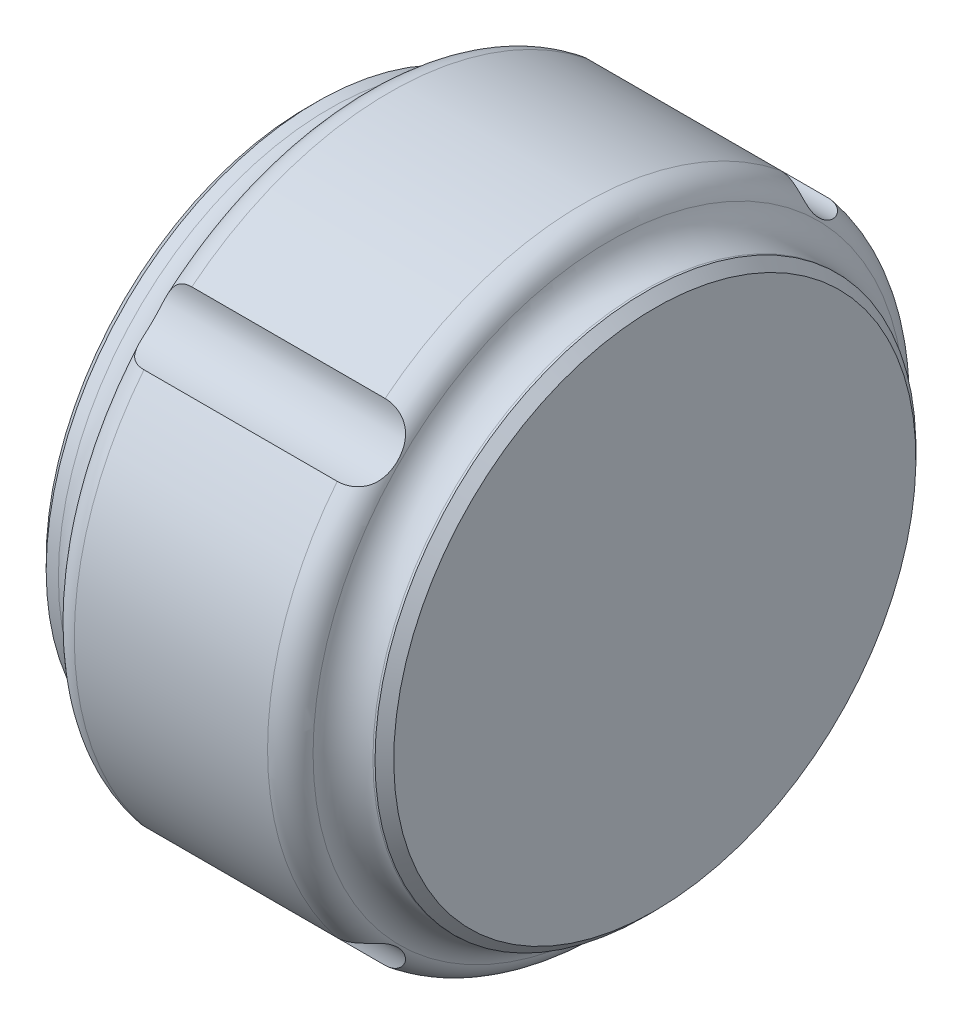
ISO-10303-21;
HEADER;
FILE_DESCRIPTION(('STEP AP214'),'2;1');
FILE_NAME('part.step','',(''),(''),'','','');
FILE_SCHEMA(('AUTOMOTIVE_DESIGN { 1 0 10303 214 1 1 1 1 }'));
ENDSEC;
DATA;
#1=APPLICATION_CONTEXT('core data for automotive mechanical design processes');
#2=APPLICATION_PROTOCOL_DEFINITION('international standard','automotive_design',2000,#1);
#3=PRODUCT_CONTEXT('',#1,'mechanical');
#4=PRODUCT('Part','Part','',(#3));
#5=PRODUCT_RELATED_PRODUCT_CATEGORY('part','',(#4));
#6=PRODUCT_DEFINITION_FORMATION('','',#4);
#7=PRODUCT_DEFINITION_CONTEXT('part definition',#1,'design');
#8=PRODUCT_DEFINITION('design','',#6,#7);
#9=PRODUCT_DEFINITION_SHAPE('','',#8);
#10=(LENGTH_UNIT() NAMED_UNIT(*) SI_UNIT(.MILLI.,.METRE.));
#11=(NAMED_UNIT(*) PLANE_ANGLE_UNIT() SI_UNIT($,.RADIAN.));
#12=(NAMED_UNIT(*) SI_UNIT($,.STERADIAN.) SOLID_ANGLE_UNIT());
#13=UNCERTAINTY_MEASURE_WITH_UNIT(LENGTH_MEASURE(1.E-05),#10,'distance_accuracy_value','');
#14=(GEOMETRIC_REPRESENTATION_CONTEXT(3) GLOBAL_UNCERTAINTY_ASSIGNED_CONTEXT((#13)) GLOBAL_UNIT_ASSIGNED_CONTEXT((#10,
#11,#12)) REPRESENTATION_CONTEXT('',''));
#15=CARTESIAN_POINT('',(0.,0.,0.));
#16=DIRECTION('',(0.,0.,1.));
#17=DIRECTION('',(1.,0.,0.));
#18=AXIS2_PLACEMENT_3D('',#15,#16,#17);
#19=CARTESIAN_POINT('',(-10.2232321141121,0.,0.));
#20=DIRECTION('',(-1.,0.,0.));
#21=DIRECTION('',(0.,0.,1.));
#22=AXIS2_PLACEMENT_3D('',#19,#20,#21);
#23=CYLINDRICAL_SURFACE('',#22,47.625);
#24=CARTESIAN_POINT('',(27.6950675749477,0.,0.));
#25=DIRECTION('',(-1.,0.,0.));
#26=DIRECTION('',(0.,0.,1.));
#27=AXIS2_PLACEMENT_3D('',#24,#25,#26);
#28=CIRCLE('',#27,47.625);
#29=CARTESIAN_POINT('',(27.6950675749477,0.,47.625));
#30=VERTEX_POINT('',#29);
#31=EDGE_CURVE('E182',#30,#30,#28,.T.);
#32=ORIENTED_EDGE('',*,*,#31,.F.);
#33=EDGE_LOOP('',(#32));
#34=FACE_BOUND('',#33,.T.);
#35=CARTESIAN_POINT('',(28.067,0.,0.));
#36=DIRECTION('',(-1.,0.,0.));
#37=DIRECTION('',(0.,-1.,0.));
#38=AXIS2_PLACEMENT_3D('',#35,#36,#37);
#39=CIRCLE('',#38,47.625);
#40=CARTESIAN_POINT('',(28.067,-47.625,0.));
#41=VERTEX_POINT('',#40);
#42=EDGE_CURVE('E287',#41,#41,#39,.T.);
#43=ORIENTED_EDGE('',*,*,#42,.T.);
#44=EDGE_LOOP('',(#43));
#45=FACE_BOUND('',#44,.T.);
#46=ADVANCED_FACE('F16',(#34,#45),#23,.T.);
#47=CARTESIAN_POINT('',(-10.2232321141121,0.,0.));
#48=DIRECTION('',(-1.,0.,0.));
#49=DIRECTION('',(0.,0.,1.));
#50=AXIS2_PLACEMENT_3D('',#47,#48,#49);
#51=CYLINDRICAL_SURFACE('',#50,47.625);
#52=CARTESIAN_POINT('',(-27.6950675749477,0.,0.));
#53=DIRECTION('',(-1.,0.,0.));
#54=DIRECTION('',(0.,0.,1.));
#55=AXIS2_PLACEMENT_3D('',#52,#53,#54);
#56=CIRCLE('',#55,47.625);
#57=CARTESIAN_POINT('',(-27.6950675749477,0.,47.625));
#58=VERTEX_POINT('',#57);
#59=EDGE_CURVE('E142',#58,#58,#56,.T.);
#60=ORIENTED_EDGE('',*,*,#59,.T.);
#61=EDGE_LOOP('',(#60));
#62=FACE_BOUND('',#61,.T.);
#63=CARTESIAN_POINT('',(-29.845,0.,0.));
#64=DIRECTION('',(-1.,0.,0.));
#65=DIRECTION('',(0.,-1.,0.));
#66=AXIS2_PLACEMENT_3D('',#63,#64,#65);
#67=CIRCLE('',#66,47.625);
#68=CARTESIAN_POINT('',(-29.845,-47.625,0.));
#69=VERTEX_POINT('',#68);
#70=EDGE_CURVE('E269',#69,#69,#67,.T.);
#71=ORIENTED_EDGE('',*,*,#70,.F.);
#72=EDGE_LOOP('',(#71));
#73=FACE_BOUND('',#72,.T.);
#74=ADVANCED_FACE('F18',(#62,#73),#51,.T.);
#75=CARTESIAN_POINT('',(-10.2232321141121,0.,0.));
#76=DIRECTION('',(-1.,0.,0.));
#77=DIRECTION('',(0.,0.,1.));
#78=AXIS2_PLACEMENT_3D('',#75,#76,#77);
#79=CYLINDRICAL_SURFACE('',#78,55.499);
#80=CARTESIAN_POINT('',(-17.018,0.,0.));
#81=DIRECTION('',(-1.,0.,0.));
#82=DIRECTION('',(0.,0.,1.));
#83=AXIS2_PLACEMENT_3D('',#80,#81,#82);
#84=CIRCLE('',#83,55.499);
#85=CARTESIAN_POINT('',(-17.018,34.8031877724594,-43.2305114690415));
#86=VERTEX_POINT('',#85);
#87=CARTESIAN_POINT('',(-17.018,-34.8031877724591,-43.2305114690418));
#88=VERTEX_POINT('',#87);
#89=EDGE_CURVE('E117',#86,#88,#84,.T.);
#90=ORIENTED_EDGE('',*,*,#89,.F.);
#91=DIRECTION('',(1.,0.,0.));
#92=VECTOR('',#91,1.);
#93=CARTESIAN_POINT('',(-34.544,34.8031877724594,-43.2305114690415));
#94=LINE('',#93,#92);
#95=CARTESIAN_POINT('',(17.018,34.8031877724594,-43.2305114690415));
#96=VERTEX_POINT('',#95);
#97=EDGE_CURVE('E106',#86,#96,#94,.T.);
#98=ORIENTED_EDGE('',*,*,#97,.T.);
#99=CARTESIAN_POINT('',(17.018,0.,0.));
#100=DIRECTION('',(-1.,0.,0.));
#101=DIRECTION('',(0.,0.,1.));
#102=AXIS2_PLACEMENT_3D('',#99,#100,#101);
#103=CIRCLE('',#102,55.499);
#104=CARTESIAN_POINT('',(17.018,-34.8031877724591,-43.2305114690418));
#105=VERTEX_POINT('',#104);
#106=EDGE_CURVE('E51',#96,#105,#103,.T.);
#107=ORIENTED_EDGE('',*,*,#106,.T.);
#108=DIRECTION('',(1.,0.,0.));
#109=VECTOR('',#108,1.);
#110=CARTESIAN_POINT('',(-34.544,-34.8031877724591,-43.2305114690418));
#111=LINE('',#110,#109);
#112=EDGE_CURVE('E123',#88,#105,#111,.T.);
#113=ORIENTED_EDGE('',*,*,#112,.F.);
#114=EDGE_LOOP('',(#90,#98,#107,#113));
#115=FACE_BOUND('',#114,.T.);
#116=ADVANCED_FACE('F125',(#115),#79,.T.);
#117=CARTESIAN_POINT('',(-17.018,-43.2305114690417,-34.8031877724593));
#118=VERTEX_POINT('',#117);
#119=CARTESIAN_POINT('',(-17.018,-43.2305114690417,34.8031877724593));
#120=VERTEX_POINT('',#119);
#121=EDGE_CURVE('E127',#118,#120,#84,.T.);
#122=ORIENTED_EDGE('',*,*,#121,.F.);
#123=DIRECTION('',(1.,0.,0.));
#124=VECTOR('',#123,1.);
#125=CARTESIAN_POINT('',(-34.544,-43.2305114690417,-34.8031877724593));
#126=LINE('',#125,#124);
#127=CARTESIAN_POINT('',(17.018,-43.2305114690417,-34.8031877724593));
#128=VERTEX_POINT('',#127);
#129=EDGE_CURVE('E209',#118,#128,#126,.T.);
#130=ORIENTED_EDGE('',*,*,#129,.T.);
#131=CARTESIAN_POINT('',(17.018,-43.2305114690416,34.8031877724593));
#132=VERTEX_POINT('',#131);
#133=EDGE_CURVE('E232',#128,#132,#103,.T.);
#134=ORIENTED_EDGE('',*,*,#133,.T.);
#135=DIRECTION('',(1.,0.,0.));
#136=VECTOR('',#135,1.);
#137=CARTESIAN_POINT('',(-34.544,-43.2305114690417,34.8031877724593));
#138=LINE('',#137,#136);
#139=EDGE_CURVE('E208',#120,#132,#138,.T.);
#140=ORIENTED_EDGE('',*,*,#139,.F.);
#141=EDGE_LOOP('',(#122,#130,#134,#140));
#142=FACE_BOUND('',#141,.T.);
#143=ADVANCED_FACE('F371',(#142),#79,.T.);
#144=CARTESIAN_POINT('',(-17.018,-34.8031877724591,43.2305114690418));
#145=VERTEX_POINT('',#144);
#146=CARTESIAN_POINT('',(-17.018,34.8031877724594,43.2305114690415));
#147=VERTEX_POINT('',#146);
#148=EDGE_CURVE('E134',#145,#147,#84,.T.);
#149=ORIENTED_EDGE('',*,*,#148,.F.);
#150=DIRECTION('',(1.,0.,0.));
#151=VECTOR('',#150,1.);
#152=CARTESIAN_POINT('',(-34.544,-34.8031877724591,43.2305114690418));
#153=LINE('',#152,#151);
#154=CARTESIAN_POINT('',(17.018,-34.8031877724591,43.2305114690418));
#155=VERTEX_POINT('',#154);
#156=EDGE_CURVE('E211',#145,#155,#153,.T.);
#157=ORIENTED_EDGE('',*,*,#156,.T.);
#158=CARTESIAN_POINT('',(17.018,34.8031877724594,43.2305114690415));
#159=VERTEX_POINT('',#158);
#160=EDGE_CURVE('E233',#155,#159,#103,.T.);
#161=ORIENTED_EDGE('',*,*,#160,.T.);
#162=DIRECTION('',(1.,0.,0.));
#163=VECTOR('',#162,1.);
#164=CARTESIAN_POINT('',(-34.544,34.8031877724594,43.2305114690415));
#165=LINE('',#164,#163);
#166=EDGE_CURVE('E184',#147,#159,#165,.T.);
#167=ORIENTED_EDGE('',*,*,#166,.F.);
#168=EDGE_LOOP('',(#149,#157,#161,#167));
#169=FACE_BOUND('',#168,.T.);
#170=ADVANCED_FACE('F242',(#169),#79,.T.);
#171=CARTESIAN_POINT('',(-27.6950675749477,0.,0.));
#172=DIRECTION('',(-1.,0.,0.));
#173=DIRECTION('',(0.,0.,1.));
#174=AXIS2_PLACEMENT_3D('',#171,#172,#173);
#175=TOROIDAL_SURFACE('',#174,53.975,6.35);
#176=ORIENTED_EDGE('',*,*,#59,.F.);
#177=EDGE_LOOP('',(#176));
#178=FACE_BOUND('',#177,.T.);
#179=CARTESIAN_POINT('',(-21.6285519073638,0.,0.));
#180=DIRECTION('',(-1.,0.,0.));
#181=DIRECTION('',(0.,0.,1.));
#182=AXIS2_PLACEMENT_3D('',#179,#180,#181);
#183=CIRCLE('',#182,52.0988636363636);
#184=CARTESIAN_POINT('',(-21.6285519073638,0.,52.0988636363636));
#185=VERTEX_POINT('',#184);
#186=EDGE_CURVE('E133',#185,#185,#183,.T.);
#187=ORIENTED_EDGE('',*,*,#186,.T.);
#188=EDGE_LOOP('',(#187));
#189=FACE_BOUND('',#188,.T.);
#190=ADVANCED_FACE('F189',(#178,#189),#175,.F.);
#191=CARTESIAN_POINT('',(-17.018,0.,0.));
#192=DIRECTION('',(-1.,0.,0.));
#193=DIRECTION('',(0.,0.,1.));
#194=AXIS2_PLACEMENT_3D('',#191,#192,#193);
#195=TOROIDAL_SURFACE('',#194,50.673,4.826);
#196=ORIENTED_EDGE('',*,*,#186,.F.);
#197=EDGE_LOOP('',(#196));
#198=FACE_BOUND('',#197,.T.);
#199=CARTESIAN_POINT('',(-17.018,43.2305114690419,34.803187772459));
#200=VERTEX_POINT('',#199);
#201=CARTESIAN_POINT('',(-17.018,43.2305114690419,-34.803187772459));
#202=VERTEX_POINT('',#201);
#203=EDGE_CURVE('E121',#200,#202,#84,.T.);
#204=ORIENTED_EDGE('',*,*,#203,.T.);
#205=CARTESIAN_POINT('',(-17.0178,43.2305114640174,-34.8031877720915));
#206=CARTESIAN_POINT('',(-17.129220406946,43.230526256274,-34.8032066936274));
#207=CARTESIAN_POINT('',(-17.2406403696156,43.2258448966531,-34.8028470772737));
#208=CARTESIAN_POINT('',(-17.4626905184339,43.207154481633,-34.8015042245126));
#209=CARTESIAN_POINT('',(-17.5733207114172,43.1931455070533,-34.8005209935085));
#210=CARTESIAN_POINT('',(-17.7929259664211,43.1558777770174,-34.7980652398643));
#211=CARTESIAN_POINT('',(-17.9019021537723,43.132625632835,-34.7965930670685));
#212=CARTESIAN_POINT('',(-18.1174982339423,43.0770093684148,-34.7934187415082));
#213=CARTESIAN_POINT('',(-18.2241181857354,43.044645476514,-34.7917165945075));
#214=CARTESIAN_POINT('',(-18.4343291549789,42.9709788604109,-34.7884240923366));
#215=CARTESIAN_POINT('',(-18.5379174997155,42.9296685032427,-34.7868338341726));
#216=CARTESIAN_POINT('',(-18.7412294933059,42.8384177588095,-34.7841926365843));
#217=CARTESIAN_POINT('',(-18.8409530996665,42.7884772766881,-34.7831417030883));
#218=CARTESIAN_POINT('',(-19.0357794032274,42.6803922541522,-34.7820684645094));
#219=CARTESIAN_POINT('',(-19.1308847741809,42.6222525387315,-34.7820455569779));
#220=CARTESIAN_POINT('',(-19.3159056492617,42.4982527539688,-34.7835571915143));
#221=CARTESIAN_POINT('',(-19.4058212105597,42.4323927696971,-34.7850917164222));
#222=CARTESIAN_POINT('',(-19.5795494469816,42.2938709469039,-34.7902543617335));
#223=CARTESIAN_POINT('',(-19.6633867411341,42.2212396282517,-34.7938734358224));
#224=CARTESIAN_POINT('',(-19.8249927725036,42.0696316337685,-34.8037286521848));
#225=CARTESIAN_POINT('',(-19.9027594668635,41.9906528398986,-34.8099656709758));
#226=CARTESIAN_POINT('',(-20.0518980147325,41.8271870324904,-34.8255514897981));
#227=CARTESIAN_POINT('',(-20.1232710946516,41.7427010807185,-34.8348996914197));
#228=CARTESIAN_POINT('',(-20.2595204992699,41.5690671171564,-34.8571351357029));
#229=CARTESIAN_POINT('',(-20.324394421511,41.4799173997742,-34.8700236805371));
#230=CARTESIAN_POINT('',(-20.5145231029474,41.1989705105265,-34.9158588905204));
#231=CARTESIAN_POINT('',(-20.6289167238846,41.0007536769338,-34.9553955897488));
#232=CARTESIAN_POINT('',(-20.8311058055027,40.595805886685,-35.0537115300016));
#233=CARTESIAN_POINT('',(-20.9188817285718,40.3890688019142,-35.1125048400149));
#234=CARTESIAN_POINT('',(-21.0498708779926,40.0323878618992,-35.2305740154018));
#235=CARTESIAN_POINT('',(-21.0986726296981,39.8828428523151,-35.2850529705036));
#236=CARTESIAN_POINT('',(-21.1858985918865,39.5847328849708,-35.4042086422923));
#237=CARTESIAN_POINT('',(-21.2243189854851,39.4361683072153,-35.4688890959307));
#238=CARTESIAN_POINT('',(-21.292257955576,39.1415168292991,-35.6082824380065));
#239=CARTESIAN_POINT('',(-21.3217646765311,38.9954334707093,-35.6830084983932));
#240=CARTESIAN_POINT('',(-21.3731352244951,38.7072423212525,-35.8420718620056));
#241=CARTESIAN_POINT('',(-21.3949996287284,38.5651342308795,-35.9264084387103));
#242=CARTESIAN_POINT('',(-21.4325204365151,38.2835155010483,-36.1058182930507));
#243=CARTESIAN_POINT('',(-21.448063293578,38.1440919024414,-36.2010516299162));
#244=CARTESIAN_POINT('',(-21.4732893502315,37.8713247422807,-36.4005598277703));
#245=CARTESIAN_POINT('',(-21.4829724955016,37.737981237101,-36.5048347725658));
#246=CARTESIAN_POINT('',(-21.4970760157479,37.4781038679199,-36.7219349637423));
#247=CARTESIAN_POINT('',(-21.5014951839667,37.3515715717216,-36.8347621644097));
#248=CARTESIAN_POINT('',(-21.5053473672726,37.1060088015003,-37.0683907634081));
#249=CARTESIAN_POINT('',(-21.5047800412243,36.9869788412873,-37.1891927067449));
#250=CARTESIAN_POINT('',(-21.4981043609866,36.7374511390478,-37.4593521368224));
#251=CARTESIAN_POINT('',(-21.4910699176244,36.6084466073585,-37.6100716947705));
#252=CARTESIAN_POINT('',(-21.4695251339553,36.3623873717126,-37.9205194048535));
#253=CARTESIAN_POINT('',(-21.4550132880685,36.2453350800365,-38.0802493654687));
#254=CARTESIAN_POINT('',(-21.4173266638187,36.0240528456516,-38.4073055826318));
#255=CARTESIAN_POINT('',(-21.3941554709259,35.9198176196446,-38.5746286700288));
#256=CARTESIAN_POINT('',(-21.3374227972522,35.7248696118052,-38.9152585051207));
#257=CARTESIAN_POINT('',(-21.3038651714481,35.6341518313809,-39.0885630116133));
#258=CARTESIAN_POINT('',(-21.2345975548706,35.4887005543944,-39.3932142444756));
#259=CARTESIAN_POINT('',(-21.2017428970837,35.4307593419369,-39.5236875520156));
#260=CARTESIAN_POINT('',(-21.128184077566,35.3227413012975,-39.7856640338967));
#261=CARTESIAN_POINT('',(-21.0874817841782,35.272662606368,-39.9171669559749));
#262=CARTESIAN_POINT('',(-20.9972768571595,35.1805078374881,-40.1797301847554));
#263=CARTESIAN_POINT('',(-20.9477876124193,35.1384197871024,-40.3107908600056));
#264=CARTESIAN_POINT('',(-20.839003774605,35.0620962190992,-40.5711271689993));
#265=CARTESIAN_POINT('',(-20.7797108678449,35.0278593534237,-40.7004031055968));
#266=CARTESIAN_POINT('',(-20.6615703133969,34.9721918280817,-40.9335848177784));
#267=CARTESIAN_POINT('',(-20.6043806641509,34.9495724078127,-41.0380483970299));
#268=CARTESIAN_POINT('',(-20.482363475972,34.909283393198,-41.2434688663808));
#269=CARTESIAN_POINT('',(-20.417533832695,34.8916151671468,-41.3444247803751));
#270=CARTESIAN_POINT('',(-20.2800999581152,34.8608646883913,-41.5416206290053));
#271=CARTESIAN_POINT('',(-20.2074970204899,34.8477816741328,-41.6378613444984));
#272=CARTESIAN_POINT('',(-20.0545762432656,34.8257088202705,-41.8244429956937));
#273=CARTESIAN_POINT('',(-19.9742620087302,34.8167170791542,-41.9147866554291));
#274=CARTESIAN_POINT('',(-19.8057516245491,34.8021915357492,-42.0889097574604));
#275=CARTESIAN_POINT('',(-19.7175214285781,34.7966735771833,-42.172657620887));
#276=CARTESIAN_POINT('',(-19.5339417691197,34.7884842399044,-42.3321155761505));
#277=CARTESIAN_POINT('',(-19.4385921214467,34.7858129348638,-42.4078254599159));
#278=CARTESIAN_POINT('',(-19.2413676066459,34.7826050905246,-42.5503595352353));
#279=CARTESIAN_POINT('',(-19.1394898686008,34.7820694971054,-42.617179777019));
#280=CARTESIAN_POINT('',(-18.9300348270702,34.7824306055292,-42.7411743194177));
#281=CARTESIAN_POINT('',(-18.8224580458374,34.7833271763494,-42.7983495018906));
#282=CARTESIAN_POINT('',(-18.6111323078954,34.7857959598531,-42.8984148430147));
#283=CARTESIAN_POINT('',(-18.5077457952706,34.7873096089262,-42.9420740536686));
#284=CARTESIAN_POINT('',(-18.2976307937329,34.790546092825,-43.0204179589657));
#285=CARTESIAN_POINT('',(-18.19090242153,34.7922689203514,-43.0551029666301));
#286=CARTESIAN_POINT('',(-17.9750364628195,34.7955492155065,-43.115226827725));
#287=CARTESIAN_POINT('',(-17.865902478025,34.7971069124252,-43.1406786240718));
#288=CARTESIAN_POINT('',(-17.645909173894,34.799779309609,-43.1822438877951));
#289=CARTESIAN_POINT('',(-17.5350507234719,34.8008942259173,-43.1983619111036));
#290=CARTESIAN_POINT('',(-17.3562492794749,34.8021864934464,-43.2166924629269));
#291=CARTESIAN_POINT('',(-17.2885990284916,34.8025601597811,-43.2218814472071));
#292=CARTESIAN_POINT('',(-17.1532348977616,34.8030617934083,-43.2287898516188));
#293=CARTESIAN_POINT('',(-17.0855213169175,34.803190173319,-43.2305150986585));
#294=CARTESIAN_POINT('',(-17.0178,34.803187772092,-43.230511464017));
#295=B_SPLINE_CURVE_WITH_KNOTS('',3,(#205,#206,#207,#208,#209,#210,#211,#212,#213,#214,#215,
#216,#217,#218,#219,#220,#221,#222,#223,#224,#225,#226,#227,#228,#229,#230,#231,#232,#233,#234,
#235,#236,#237,#238,#239,#240,#241,#242,#243,#244,#245,#246,#247,#248,#249,#250,#251,#252,#253,
#254,#255,#256,#257,#258,#259,#260,#261,#262,#263,#264,#265,#266,#267,#268,#269,#270,#271,#272,
#273,#274,#275,#276,#277,#278,#279,#280,#281,#282,#283,#284,#285,#286,#287,#288,#289,#290,#291,
#292,#293,#294),.UNSPECIFIED.,.F.,.F.,(4,2,2,2,2,2,2,2,2,2,2,2,2,2,2,2,2,2,2,2,2,2,2,2,2,2,2,2,
2,2,2,2,2,2,2,2,2,2,2,2,2,2,2,2,4),(0.,0.334161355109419,0.668319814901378,1.00223969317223,
1.33615120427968,1.67034873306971,2.00454993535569,2.33855528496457,2.6725569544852,
3.00511996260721,3.33779440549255,3.67040489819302,4.00313789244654,4.69689919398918,
5.39116849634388,5.88995640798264,6.38892745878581,6.88855926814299,7.38815333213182,
7.89636198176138,8.40457534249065,8.91290518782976,9.42126980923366,10.0161049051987,
10.6110598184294,11.2057686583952,11.800257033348,12.2393547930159,12.6783481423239,
13.1166782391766,13.5549330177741,13.9182384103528,14.2816441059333,14.6449894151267,
15.0081656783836,15.37298659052,15.7378169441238,16.1028088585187,16.467767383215,
16.8040762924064,17.1403734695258,17.4761973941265,17.8118572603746,18.0153260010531,
18.2184521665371),.UNSPECIFIED.);
#296=EDGE_CURVE('E109',#202,#86,#295,.T.);
#297=ORIENTED_EDGE('',*,*,#296,.T.);
#298=ORIENTED_EDGE('',*,*,#89,.T.);
#299=CARTESIAN_POINT('',(-17.0178,-34.8031877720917,-43.2305114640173));
#300=CARTESIAN_POINT('',(-17.129220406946,-34.8032066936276,-43.2305262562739));
#301=CARTESIAN_POINT('',(-17.2406403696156,-34.8028470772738,-43.225844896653));
#302=CARTESIAN_POINT('',(-17.4626905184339,-34.8015042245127,-43.2071544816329));
#303=CARTESIAN_POINT('',(-17.5733207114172,-34.8005209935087,-43.1931455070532));
#304=CARTESIAN_POINT('',(-17.7929259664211,-34.7980652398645,-43.1558777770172));
#305=CARTESIAN_POINT('',(-17.9019021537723,-34.7965930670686,-43.1326256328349));
#306=CARTESIAN_POINT('',(-18.1174982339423,-34.7934187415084,-43.0770093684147));
#307=CARTESIAN_POINT('',(-18.2241181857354,-34.7917165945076,-43.0446454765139));
#308=CARTESIAN_POINT('',(-18.4343291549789,-34.7884240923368,-42.9709788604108));
#309=CARTESIAN_POINT('',(-18.5379174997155,-34.7868338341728,-42.9296685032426));
#310=CARTESIAN_POINT('',(-18.7412294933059,-34.7841926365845,-42.8384177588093));
#311=CARTESIAN_POINT('',(-18.8409530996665,-34.7831417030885,-42.788477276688));
#312=CARTESIAN_POINT('',(-19.0357794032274,-34.7820684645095,-42.6803922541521));
#313=CARTESIAN_POINT('',(-19.130884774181,-34.782045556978,-42.6222525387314));
#314=CARTESIAN_POINT('',(-19.3159056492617,-34.7835571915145,-42.4982527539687));
#315=CARTESIAN_POINT('',(-19.4058212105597,-34.7850917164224,-42.432392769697));
#316=CARTESIAN_POINT('',(-19.5795494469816,-34.7902543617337,-42.2938709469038));
#317=CARTESIAN_POINT('',(-19.6633867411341,-34.7938734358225,-42.2212396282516));
#318=CARTESIAN_POINT('',(-19.8249927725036,-34.803728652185,-42.0696316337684));
#319=CARTESIAN_POINT('',(-19.9027594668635,-34.8099656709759,-41.9906528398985));
#320=CARTESIAN_POINT('',(-20.0518980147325,-34.8255514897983,-41.8271870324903));
#321=CARTESIAN_POINT('',(-20.1232710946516,-34.8348996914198,-41.7427010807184));
#322=CARTESIAN_POINT('',(-20.2595204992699,-34.8571351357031,-41.5690671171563));
#323=CARTESIAN_POINT('',(-20.324394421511,-34.8700236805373,-41.4799173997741));
#324=CARTESIAN_POINT('',(-20.5145231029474,-34.9158588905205,-41.1989705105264));
#325=CARTESIAN_POINT('',(-20.6289167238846,-34.955395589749,-41.0007536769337));
#326=CARTESIAN_POINT('',(-20.8311058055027,-35.0537115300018,-40.5958058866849));
#327=CARTESIAN_POINT('',(-20.9188817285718,-35.112504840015,-40.3890688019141));
#328=CARTESIAN_POINT('',(-21.0498708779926,-35.2305740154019,-40.0323878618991));
#329=CARTESIAN_POINT('',(-21.0986726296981,-35.2850529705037,-39.8828428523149));
#330=CARTESIAN_POINT('',(-21.1858985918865,-35.4042086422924,-39.5847328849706));
#331=CARTESIAN_POINT('',(-21.2243189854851,-35.4688890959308,-39.4361683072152));
#332=CARTESIAN_POINT('',(-21.292257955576,-35.6082824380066,-39.141516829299));
#333=CARTESIAN_POINT('',(-21.3217646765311,-35.6830084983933,-38.9954334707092));
#334=CARTESIAN_POINT('',(-21.3731352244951,-35.8420718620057,-38.7072423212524));
#335=CARTESIAN_POINT('',(-21.3949996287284,-35.9264084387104,-38.5651342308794));
#336=CARTESIAN_POINT('',(-21.4325204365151,-36.1058182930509,-38.2835155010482));
#337=CARTESIAN_POINT('',(-21.448063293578,-36.2010516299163,-38.1440919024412));
#338=CARTESIAN_POINT('',(-21.4732893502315,-36.4005598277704,-37.8713247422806));
#339=CARTESIAN_POINT('',(-21.4829724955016,-36.5048347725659,-37.7379812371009));
#340=CARTESIAN_POINT('',(-21.4970760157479,-36.7219349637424,-37.4781038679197));
#341=CARTESIAN_POINT('',(-21.5014951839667,-36.8347621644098,-37.3515715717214));
#342=CARTESIAN_POINT('',(-21.5053473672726,-37.0683907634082,-37.1060088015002));
#343=CARTESIAN_POINT('',(-21.5047800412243,-37.189192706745,-36.9869788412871));
#344=CARTESIAN_POINT('',(-21.4981043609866,-37.4593521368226,-36.7374511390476));
#345=CARTESIAN_POINT('',(-21.4910699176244,-37.6100716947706,-36.6084466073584));
#346=CARTESIAN_POINT('',(-21.4695251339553,-37.9205194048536,-36.3623873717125));
#347=CARTESIAN_POINT('',(-21.4550132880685,-38.0802493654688,-36.2453350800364));
#348=CARTESIAN_POINT('',(-21.4173266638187,-38.407305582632,-36.0240528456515));
#349=CARTESIAN_POINT('',(-21.3941554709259,-38.5746286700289,-35.9198176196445));
#350=CARTESIAN_POINT('',(-21.3374227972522,-38.9152585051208,-35.7248696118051));
#351=CARTESIAN_POINT('',(-21.3038651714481,-39.0885630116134,-35.6341518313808));
#352=CARTESIAN_POINT('',(-21.2345975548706,-39.3932142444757,-35.4887005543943));
#353=CARTESIAN_POINT('',(-21.2017428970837,-39.5236875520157,-35.4307593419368));
#354=CARTESIAN_POINT('',(-21.128184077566,-39.7856640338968,-35.3227413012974));
#355=CARTESIAN_POINT('',(-21.0874817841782,-39.917166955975,-35.2726626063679));
#356=CARTESIAN_POINT('',(-20.9972768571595,-40.1797301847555,-35.1805078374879));
#357=CARTESIAN_POINT('',(-20.9477876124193,-40.3107908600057,-35.1384197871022));
#358=CARTESIAN_POINT('',(-20.839003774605,-40.5711271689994,-35.062096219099));
#359=CARTESIAN_POINT('',(-20.7797108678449,-40.7004031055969,-35.0278593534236));
#360=CARTESIAN_POINT('',(-20.6615703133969,-40.9335848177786,-34.9721918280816));
#361=CARTESIAN_POINT('',(-20.6043806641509,-41.03804839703,-34.9495724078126));
#362=CARTESIAN_POINT('',(-20.482363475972,-41.2434688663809,-34.9092833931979));
#363=CARTESIAN_POINT('',(-20.417533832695,-41.3444247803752,-34.8916151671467));
#364=CARTESIAN_POINT('',(-20.2800999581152,-41.5416206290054,-34.8608646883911));
#365=CARTESIAN_POINT('',(-20.2074970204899,-41.6378613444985,-34.8477816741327));
#366=CARTESIAN_POINT('',(-20.0545762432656,-41.8244429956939,-34.8257088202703));
#367=CARTESIAN_POINT('',(-19.9742620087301,-41.9147866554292,-34.8167170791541));
#368=CARTESIAN_POINT('',(-19.805751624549,-42.0889097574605,-34.8021915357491));
#369=CARTESIAN_POINT('',(-19.7175214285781,-42.1726576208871,-34.7966735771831));
#370=CARTESIAN_POINT('',(-19.5339417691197,-42.3321155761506,-34.7884842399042));
#371=CARTESIAN_POINT('',(-19.4385921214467,-42.407825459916,-34.7858129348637));
#372=CARTESIAN_POINT('',(-19.2413676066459,-42.5503595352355,-34.7826050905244));
#373=CARTESIAN_POINT('',(-19.1394898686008,-42.6171797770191,-34.7820694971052));
#374=CARTESIAN_POINT('',(-18.9300348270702,-42.7411743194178,-34.7824306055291));
#375=CARTESIAN_POINT('',(-18.8224580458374,-42.7983495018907,-34.7833271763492));
#376=CARTESIAN_POINT('',(-18.6111323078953,-42.8984148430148,-34.785795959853));
#377=CARTESIAN_POINT('',(-18.5077457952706,-42.9420740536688,-34.7873096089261));
#378=CARTESIAN_POINT('',(-18.2976307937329,-43.0204179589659,-34.7905460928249));
#379=CARTESIAN_POINT('',(-18.19090242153,-43.0551029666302,-34.7922689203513));
#380=CARTESIAN_POINT('',(-17.9750364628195,-43.1152268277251,-34.7955492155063));
#381=CARTESIAN_POINT('',(-17.865902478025,-43.140678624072,-34.797106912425));
#382=CARTESIAN_POINT('',(-17.645909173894,-43.1822438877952,-34.7997793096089));
#383=CARTESIAN_POINT('',(-17.5350507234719,-43.1983619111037,-34.8008942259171));
#384=CARTESIAN_POINT('',(-17.3562492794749,-43.216692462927,-34.8021864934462));
#385=CARTESIAN_POINT('',(-17.2885990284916,-43.2218814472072,-34.8025601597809));
#386=CARTESIAN_POINT('',(-17.1532348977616,-43.2287898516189,-34.8030617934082));
#387=CARTESIAN_POINT('',(-17.0855213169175,-43.2305150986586,-34.8031901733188));
#388=CARTESIAN_POINT('',(-17.0178,-43.2305114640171,-34.8031877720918));
#389=B_SPLINE_CURVE_WITH_KNOTS('',3,(#299,#300,#301,#302,#303,#304,#305,#306,#307,#308,#309,
#310,#311,#312,#313,#314,#315,#316,#317,#318,#319,#320,#321,#322,#323,#324,#325,#326,#327,#328,
#329,#330,#331,#332,#333,#334,#335,#336,#337,#338,#339,#340,#341,#342,#343,#344,#345,#346,#347,
#348,#349,#350,#351,#352,#353,#354,#355,#356,#357,#358,#359,#360,#361,#362,#363,#364,#365,#366,
#367,#368,#369,#370,#371,#372,#373,#374,#375,#376,#377,#378,#379,#380,#381,#382,#383,#384,#385,
#386,#387,#388),.UNSPECIFIED.,.F.,.F.,(4,2,2,2,2,2,2,2,2,2,2,2,2,2,2,2,2,2,2,2,2,2,2,2,2,2,2,2,
2,2,2,2,2,2,2,2,2,2,2,2,2,2,2,2,4),(0.,0.334161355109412,0.668319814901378,1.00223969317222,
1.33615120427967,1.6703487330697,2.00454993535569,2.33855528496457,2.67255695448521,
3.00511996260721,3.33779440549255,3.67040489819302,4.00313789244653,4.69689919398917,
5.39116849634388,5.88995640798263,6.38892745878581,6.888559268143,7.38815333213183,
7.89636198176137,8.40457534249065,8.91290518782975,9.42126980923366,10.0161049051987,
10.6110598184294,11.2057686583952,11.800257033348,12.2393547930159,12.6783481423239,
13.1166782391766,13.5549330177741,13.9182384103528,14.2816441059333,14.6449894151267,
15.0081656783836,15.37298659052,15.7378169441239,16.1028088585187,16.467767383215,
16.8040762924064,17.1403734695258,17.4761973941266,17.8118572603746,18.0153260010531,
18.2184521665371),.UNSPECIFIED.);
#390=EDGE_CURVE('E201',#88,#118,#389,.T.);
#391=ORIENTED_EDGE('',*,*,#390,.T.);
#392=ORIENTED_EDGE('',*,*,#121,.T.);
#393=CARTESIAN_POINT('',(-17.0178,-43.2305114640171,34.8031877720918));
#394=CARTESIAN_POINT('',(-17.129220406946,-43.2305262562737,34.8032066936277));
#395=CARTESIAN_POINT('',(-17.2406403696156,-43.2258448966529,34.802847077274));
#396=CARTESIAN_POINT('',(-17.4626905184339,-43.2071544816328,34.8015042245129));
#397=CARTESIAN_POINT('',(-17.5733207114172,-43.1931455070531,34.8005209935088));
#398=CARTESIAN_POINT('',(-17.7929259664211,-43.1558777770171,34.7980652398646));
#399=CARTESIAN_POINT('',(-17.9019021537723,-43.1326256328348,34.7965930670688));
#400=CARTESIAN_POINT('',(-18.1174982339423,-43.0770093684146,34.7934187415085));
#401=CARTESIAN_POINT('',(-18.2241181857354,-43.0446454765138,34.7917165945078));
#402=CARTESIAN_POINT('',(-18.4343291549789,-42.9709788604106,34.7884240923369));
#403=CARTESIAN_POINT('',(-18.5379174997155,-42.9296685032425,34.7868338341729));
#404=CARTESIAN_POINT('',(-18.7412294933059,-42.8384177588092,34.7841926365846));
#405=CARTESIAN_POINT('',(-18.8409530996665,-42.7884772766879,34.7831417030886));
#406=CARTESIAN_POINT('',(-19.0357794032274,-42.680392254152,34.7820684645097));
#407=CARTESIAN_POINT('',(-19.1308847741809,-42.6222525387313,34.7820455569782));
#408=CARTESIAN_POINT('',(-19.3159056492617,-42.4982527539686,34.7835571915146));
#409=CARTESIAN_POINT('',(-19.4058212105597,-42.4323927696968,34.7850917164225));
#410=CARTESIAN_POINT('',(-19.5795494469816,-42.2938709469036,34.7902543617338));
#411=CARTESIAN_POINT('',(-19.6633867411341,-42.2212396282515,34.7938734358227));
#412=CARTESIAN_POINT('',(-19.8249927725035,-42.0696316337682,34.8037286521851));
#413=CARTESIAN_POINT('',(-19.9027594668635,-41.9906528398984,34.8099656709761));
#414=CARTESIAN_POINT('',(-20.0518980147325,-41.8271870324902,34.8255514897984));
#415=CARTESIAN_POINT('',(-20.1232710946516,-41.7427010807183,34.83489969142));
#416=CARTESIAN_POINT('',(-20.2595204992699,-41.5690671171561,34.8571351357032));
#417=CARTESIAN_POINT('',(-20.324394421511,-41.479917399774,34.8700236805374));
#418=CARTESIAN_POINT('',(-20.5145231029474,-41.1989705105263,34.9158588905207));
#419=CARTESIAN_POINT('',(-20.6289167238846,-41.0007536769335,34.9553955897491));
#420=CARTESIAN_POINT('',(-20.8311058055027,-40.5958058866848,35.0537115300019));
#421=CARTESIAN_POINT('',(-20.9188817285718,-40.3890688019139,35.1125048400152));
#422=CARTESIAN_POINT('',(-21.0498708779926,-40.032387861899,35.2305740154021));
#423=CARTESIAN_POINT('',(-21.0986726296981,-39.8828428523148,35.2850529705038));
#424=CARTESIAN_POINT('',(-21.1858985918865,-39.5847328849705,35.4042086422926));
#425=CARTESIAN_POINT('',(-21.2243189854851,-39.436168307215,35.468889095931));
#426=CARTESIAN_POINT('',(-21.292257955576,-39.1415168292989,35.6082824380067));
#427=CARTESIAN_POINT('',(-21.3217646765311,-38.9954334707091,35.6830084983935));
#428=CARTESIAN_POINT('',(-21.3731352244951,-38.7072423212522,35.8420718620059));
#429=CARTESIAN_POINT('',(-21.3949996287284,-38.5651342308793,35.9264084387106));
#430=CARTESIAN_POINT('',(-21.4325204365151,-38.2835155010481,36.105818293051));
#431=CARTESIAN_POINT('',(-21.448063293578,-38.1440919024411,36.2010516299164));
#432=CARTESIAN_POINT('',(-21.4732893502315,-37.8713247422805,36.4005598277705));
#433=CARTESIAN_POINT('',(-21.4829724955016,-37.7379812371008,36.5048347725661));
#434=CARTESIAN_POINT('',(-21.4970760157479,-37.4781038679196,36.7219349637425));
#435=CARTESIAN_POINT('',(-21.5014951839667,-37.3515715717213,36.83476216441));
#436=CARTESIAN_POINT('',(-21.5053473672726,-37.1060088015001,37.0683907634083));
#437=CARTESIAN_POINT('',(-21.5047800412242,-36.986978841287,37.1891927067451));
#438=CARTESIAN_POINT('',(-21.4981043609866,-36.7374511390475,37.4593521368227));
#439=CARTESIAN_POINT('',(-21.4910699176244,-36.6084466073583,37.6100716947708));
#440=CARTESIAN_POINT('',(-21.4695251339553,-36.3623873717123,37.9205194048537));
#441=CARTESIAN_POINT('',(-21.4550132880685,-36.2453350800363,38.0802493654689));
#442=CARTESIAN_POINT('',(-21.4173266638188,-36.0240528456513,38.4073055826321));
#443=CARTESIAN_POINT('',(-21.3941554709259,-35.9198176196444,38.574628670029));
#444=CARTESIAN_POINT('',(-21.3374227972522,-35.724869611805,38.9152585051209));
#445=CARTESIAN_POINT('',(-21.3038651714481,-35.6341518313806,39.0885630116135));
#446=CARTESIAN_POINT('',(-21.2345975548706,-35.4887005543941,39.3932142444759));
#447=CARTESIAN_POINT('',(-21.2017428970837,-35.4307593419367,39.5236875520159));
#448=CARTESIAN_POINT('',(-21.128184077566,-35.3227413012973,39.7856640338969));
#449=CARTESIAN_POINT('',(-21.0874817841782,-35.2726626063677,39.9171669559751));
#450=CARTESIAN_POINT('',(-20.9972768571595,-35.1805078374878,40.1797301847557));
#451=CARTESIAN_POINT('',(-20.9477876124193,-35.1384197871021,40.3107908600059));
#452=CARTESIAN_POINT('',(-20.839003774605,-35.0620962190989,40.5711271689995));
#453=CARTESIAN_POINT('',(-20.7797108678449,-35.0278593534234,40.700403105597));
#454=CARTESIAN_POINT('',(-20.6615703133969,-34.9721918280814,40.9335848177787));
#455=CARTESIAN_POINT('',(-20.6043806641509,-34.9495724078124,41.0380483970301));
#456=CARTESIAN_POINT('',(-20.482363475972,-34.9092833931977,41.243468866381));
#457=CARTESIAN_POINT('',(-20.417533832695,-34.8916151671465,41.3444247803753));
#458=CARTESIAN_POINT('',(-20.2800999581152,-34.860864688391,41.5416206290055));
#459=CARTESIAN_POINT('',(-20.2074970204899,-34.8477816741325,41.6378613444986));
#460=CARTESIAN_POINT('',(-20.0545762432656,-34.8257088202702,41.824442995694));
#461=CARTESIAN_POINT('',(-19.9742620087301,-34.8167170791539,41.9147866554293));
#462=CARTESIAN_POINT('',(-19.805751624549,-34.8021915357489,42.0889097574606));
#463=CARTESIAN_POINT('',(-19.7175214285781,-34.796673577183,42.1726576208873));
#464=CARTESIAN_POINT('',(-19.5339417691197,-34.7884842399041,42.3321155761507));
#465=CARTESIAN_POINT('',(-19.4385921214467,-34.7858129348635,42.4078254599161));
#466=CARTESIAN_POINT('',(-19.2413676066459,-34.7826050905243,42.5503595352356));
#467=CARTESIAN_POINT('',(-19.1394898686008,-34.7820694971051,42.6171797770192));
#468=CARTESIAN_POINT('',(-18.9300348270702,-34.7824306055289,42.7411743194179));
#469=CARTESIAN_POINT('',(-18.8224580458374,-34.7833271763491,42.7983495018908));
#470=CARTESIAN_POINT('',(-18.6111323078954,-34.7857959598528,42.8984148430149));
#471=CARTESIAN_POINT('',(-18.5077457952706,-34.7873096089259,42.9420740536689));
#472=CARTESIAN_POINT('',(-18.2976307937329,-34.7905460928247,43.020417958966));
#473=CARTESIAN_POINT('',(-18.19090242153,-34.7922689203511,43.0551029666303));
#474=CARTESIAN_POINT('',(-17.9750364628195,-34.7955492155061,43.1152268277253));
#475=CARTESIAN_POINT('',(-17.865902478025,-34.7971069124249,43.1406786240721));
#476=CARTESIAN_POINT('',(-17.645909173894,-34.7997793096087,43.1822438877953));
#477=CARTESIAN_POINT('',(-17.5350507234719,-34.800894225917,43.1983619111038));
#478=CARTESIAN_POINT('',(-17.3562492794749,-34.8021864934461,43.2166924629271));
#479=CARTESIAN_POINT('',(-17.2885990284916,-34.8025601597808,43.2218814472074));
#480=CARTESIAN_POINT('',(-17.1532348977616,-34.803061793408,43.228789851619));
#481=CARTESIAN_POINT('',(-17.0855213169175,-34.8031901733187,43.2305150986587));
#482=CARTESIAN_POINT('',(-17.0178,-34.8031877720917,43.2305114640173));
#483=B_SPLINE_CURVE_WITH_KNOTS('',3,(#393,#394,#395,#396,#397,#398,#399,#400,#401,#402,#403,
#404,#405,#406,#407,#408,#409,#410,#411,#412,#413,#414,#415,#416,#417,#418,#419,#420,#421,#422,
#423,#424,#425,#426,#427,#428,#429,#430,#431,#432,#433,#434,#435,#436,#437,#438,#439,#440,#441,
#442,#443,#444,#445,#446,#447,#448,#449,#450,#451,#452,#453,#454,#455,#456,#457,#458,#459,#460,
#461,#462,#463,#464,#465,#466,#467,#468,#469,#470,#471,#472,#473,#474,#475,#476,#477,#478,#479,
#480,#481,#482),.UNSPECIFIED.,.F.,.F.,(4,2,2,2,2,2,2,2,2,2,2,2,2,2,2,2,2,2,2,2,2,2,2,2,2,2,2,2,
2,2,2,2,2,2,2,2,2,2,2,2,2,2,2,2,4),(0.,0.334161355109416,0.66831981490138,1.00223969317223,
1.33615120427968,1.67034873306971,2.00454993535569,2.33855528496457,2.6725569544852,
3.0051199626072,3.33779440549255,3.67040489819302,4.00313789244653,4.69689919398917,
5.39116849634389,5.88995640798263,6.3889274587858,6.888559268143,7.38815333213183,
7.89636198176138,8.40457534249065,8.91290518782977,9.42126980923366,10.0161049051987,
10.6110598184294,11.2057686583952,11.800257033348,12.239354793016,12.6783481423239,
13.1166782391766,13.5549330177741,13.9182384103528,14.2816441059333,14.6449894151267,
15.0081656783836,15.37298659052,15.7378169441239,16.1028088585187,16.467767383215,
16.8040762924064,17.1403734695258,17.4761973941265,17.8118572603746,18.0153260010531,
18.2184521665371),.UNSPECIFIED.);
#484=EDGE_CURVE('E195',#120,#145,#483,.T.);
#485=ORIENTED_EDGE('',*,*,#484,.T.);
#486=ORIENTED_EDGE('',*,*,#148,.T.);
#487=CARTESIAN_POINT('',(-17.0178,34.803187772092,43.230511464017));
#488=CARTESIAN_POINT('',(-17.129220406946,34.8032066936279,43.2305262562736));
#489=CARTESIAN_POINT('',(-17.2406403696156,34.8028470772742,43.2258448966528));
#490=CARTESIAN_POINT('',(-17.4626905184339,34.801504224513,43.2071544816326));
#491=CARTESIAN_POINT('',(-17.5733207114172,34.800520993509,43.1931455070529));
#492=CARTESIAN_POINT('',(-17.7929259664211,34.7980652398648,43.155877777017));
#493=CARTESIAN_POINT('',(-17.9019021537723,34.7965930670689,43.1326256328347));
#494=CARTESIAN_POINT('',(-18.1174982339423,34.7934187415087,43.0770093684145));
#495=CARTESIAN_POINT('',(-18.2241181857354,34.7917165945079,43.0446454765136));
#496=CARTESIAN_POINT('',(-18.4343291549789,34.7884240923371,42.9709788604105));
#497=CARTESIAN_POINT('',(-18.5379174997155,34.7868338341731,42.9296685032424));
#498=CARTESIAN_POINT('',(-18.7412294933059,34.7841926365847,42.8384177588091));
#499=CARTESIAN_POINT('',(-18.8409530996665,34.7831417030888,42.7884772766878));
#500=CARTESIAN_POINT('',(-19.0357794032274,34.7820684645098,42.6803922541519));
#501=CARTESIAN_POINT('',(-19.130884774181,34.7820455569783,42.6222525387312));
#502=CARTESIAN_POINT('',(-19.3159056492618,34.7835571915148,42.4982527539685));
#503=CARTESIAN_POINT('',(-19.4058212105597,34.7850917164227,42.4323927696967));
#504=CARTESIAN_POINT('',(-19.5795494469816,34.790254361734,42.2938709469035));
#505=CARTESIAN_POINT('',(-19.6633867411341,34.7938734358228,42.2212396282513));
#506=CARTESIAN_POINT('',(-19.8249927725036,34.8037286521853,42.0696316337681));
#507=CARTESIAN_POINT('',(-19.9027594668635,34.8099656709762,41.9906528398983));
#508=CARTESIAN_POINT('',(-20.0518980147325,34.8255514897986,41.8271870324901));
#509=CARTESIAN_POINT('',(-20.1232710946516,34.8348996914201,41.7427010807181));
#510=CARTESIAN_POINT('',(-20.2595204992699,34.8571351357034,41.569067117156));
#511=CARTESIAN_POINT('',(-20.324394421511,34.8700236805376,41.4799173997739));
#512=CARTESIAN_POINT('',(-20.5145231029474,34.9158588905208,41.1989705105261));
#513=CARTESIAN_POINT('',(-20.6289167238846,34.9553955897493,41.0007536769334));
#514=CARTESIAN_POINT('',(-20.8311058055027,35.0537115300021,40.5958058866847));
#515=CARTESIAN_POINT('',(-20.9188817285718,35.1125048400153,40.3890688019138));
#516=CARTESIAN_POINT('',(-21.0498708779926,35.2305740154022,40.0323878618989));
#517=CARTESIAN_POINT('',(-21.0986726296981,35.285052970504,39.8828428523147));
#518=CARTESIAN_POINT('',(-21.1858985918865,35.4042086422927,39.5847328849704));
#519=CARTESIAN_POINT('',(-21.2243189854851,35.4688890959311,39.4361683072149));
#520=CARTESIAN_POINT('',(-21.292257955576,35.6082824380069,39.1415168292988));
#521=CARTESIAN_POINT('',(-21.3217646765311,35.6830084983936,38.995433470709));
#522=CARTESIAN_POINT('',(-21.3731352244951,35.842071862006,38.7072423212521));
#523=CARTESIAN_POINT('',(-21.3949996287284,35.9264084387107,38.5651342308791));
#524=CARTESIAN_POINT('',(-21.4325204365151,36.1058182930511,38.2835155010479));
#525=CARTESIAN_POINT('',(-21.448063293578,36.2010516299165,38.144091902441));
#526=CARTESIAN_POINT('',(-21.4732893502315,36.4005598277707,37.8713247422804));
#527=CARTESIAN_POINT('',(-21.4829724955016,36.5048347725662,37.7379812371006));
#528=CARTESIAN_POINT('',(-21.4970760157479,36.7219349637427,37.4781038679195));
#529=CARTESIAN_POINT('',(-21.5014951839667,36.8347621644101,37.3515715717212));
#530=CARTESIAN_POINT('',(-21.5053473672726,37.0683907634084,37.1060088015));
#531=CARTESIAN_POINT('',(-21.5047800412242,37.1891927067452,36.9869788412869));
#532=CARTESIAN_POINT('',(-21.4981043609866,37.4593521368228,36.7374511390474));
#533=CARTESIAN_POINT('',(-21.4910699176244,37.6100716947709,36.6084466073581));
#534=CARTESIAN_POINT('',(-21.4695251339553,37.9205194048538,36.3623873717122));
#535=CARTESIAN_POINT('',(-21.4550132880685,38.080249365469,36.2453350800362));
#536=CARTESIAN_POINT('',(-21.4173266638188,38.4073055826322,36.0240528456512));
#537=CARTESIAN_POINT('',(-21.3941554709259,38.5746286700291,35.9198176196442));
#538=CARTESIAN_POINT('',(-21.3374227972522,38.915258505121,35.7248696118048));
#539=CARTESIAN_POINT('',(-21.3038651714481,39.0885630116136,35.6341518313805));
#540=CARTESIAN_POINT('',(-21.2345975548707,39.393214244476,35.488700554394));
#541=CARTESIAN_POINT('',(-21.2017428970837,39.523687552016,35.4307593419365));
#542=CARTESIAN_POINT('',(-21.128184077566,39.785664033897,35.3227413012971));
#543=CARTESIAN_POINT('',(-21.0874817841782,39.9171669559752,35.2726626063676));
#544=CARTESIAN_POINT('',(-20.9972768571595,40.1797301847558,35.1805078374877));
#545=CARTESIAN_POINT('',(-20.9477876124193,40.310790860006,35.138419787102));
#546=CARTESIAN_POINT('',(-20.839003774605,40.5711271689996,35.0620962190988));
#547=CARTESIAN_POINT('',(-20.7797108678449,40.7004031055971,35.0278593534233));
#548=CARTESIAN_POINT('',(-20.6615703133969,40.9335848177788,34.9721918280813));
#549=CARTESIAN_POINT('',(-20.6043806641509,41.0380483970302,34.9495724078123));
#550=CARTESIAN_POINT('',(-20.482363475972,41.2434688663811,34.9092833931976));
#551=CARTESIAN_POINT('',(-20.417533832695,41.3444247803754,34.8916151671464));
#552=CARTESIAN_POINT('',(-20.2800999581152,41.5416206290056,34.8608646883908));
#553=CARTESIAN_POINT('',(-20.2074970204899,41.6378613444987,34.8477816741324));
#554=CARTESIAN_POINT('',(-20.0545762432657,41.8244429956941,34.8257088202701));
#555=CARTESIAN_POINT('',(-19.9742620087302,41.9147866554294,34.8167170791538));
#556=CARTESIAN_POINT('',(-19.8057516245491,42.0889097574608,34.8021915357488));
#557=CARTESIAN_POINT('',(-19.7175214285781,42.1726576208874,34.7966735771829));
#558=CARTESIAN_POINT('',(-19.5339417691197,42.3321155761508,34.7884842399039));
#559=CARTESIAN_POINT('',(-19.4385921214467,42.4078254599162,34.7858129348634));
#560=CARTESIAN_POINT('',(-19.2413676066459,42.5503595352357,34.7826050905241));
#561=CARTESIAN_POINT('',(-19.1394898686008,42.6171797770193,34.7820694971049));
#562=CARTESIAN_POINT('',(-18.9300348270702,42.7411743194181,34.7824306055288));
#563=CARTESIAN_POINT('',(-18.8224580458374,42.7983495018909,34.7833271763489));
#564=CARTESIAN_POINT('',(-18.6111323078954,42.898414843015,34.7857959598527));
#565=CARTESIAN_POINT('',(-18.5077457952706,42.942074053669,34.7873096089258));
#566=CARTESIAN_POINT('',(-18.2976307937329,43.0204179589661,34.7905460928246));
#567=CARTESIAN_POINT('',(-18.19090242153,43.0551029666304,34.792268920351));
#568=CARTESIAN_POINT('',(-17.9750364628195,43.1152268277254,34.795549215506));
#569=CARTESIAN_POINT('',(-17.865902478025,43.1406786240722,34.7971069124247));
#570=CARTESIAN_POINT('',(-17.645909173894,43.1822438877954,34.7997793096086));
#571=CARTESIAN_POINT('',(-17.5350507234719,43.1983619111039,34.8008942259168));
#572=CARTESIAN_POINT('',(-17.3562492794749,43.2166924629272,34.8021864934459));
#573=CARTESIAN_POINT('',(-17.2885990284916,43.2218814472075,34.8025601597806));
#574=CARTESIAN_POINT('',(-17.1532348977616,43.2287898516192,34.8030617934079));
#575=CARTESIAN_POINT('',(-17.0855213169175,43.2305150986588,34.8031901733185));
#576=CARTESIAN_POINT('',(-17.0178,43.2305114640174,34.8031877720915));
#577=B_SPLINE_CURVE_WITH_KNOTS('',3,(#487,#488,#489,#490,#491,#492,#493,#494,#495,#496,#497,
#498,#499,#500,#501,#502,#503,#504,#505,#506,#507,#508,#509,#510,#511,#512,#513,#514,#515,#516,
#517,#518,#519,#520,#521,#522,#523,#524,#525,#526,#527,#528,#529,#530,#531,#532,#533,#534,#535,
#536,#537,#538,#539,#540,#541,#542,#543,#544,#545,#546,#547,#548,#549,#550,#551,#552,#553,#554,
#555,#556,#557,#558,#559,#560,#561,#562,#563,#564,#565,#566,#567,#568,#569,#570,#571,#572,#573,
#574,#575,#576),.UNSPECIFIED.,.F.,.F.,(4,2,2,2,2,2,2,2,2,2,2,2,2,2,2,2,2,2,2,2,2,2,2,2,2,2,2,2,
2,2,2,2,2,2,2,2,2,2,2,2,2,2,2,2,4),(0.,0.334161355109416,0.668319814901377,1.00223969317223,
1.33615120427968,1.67034873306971,2.00454993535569,2.33855528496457,2.67255695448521,
3.00511996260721,3.33779440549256,3.67040489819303,4.00313789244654,4.69689919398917,
5.39116849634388,5.88995640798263,6.3889274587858,6.88855926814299,7.38815333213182,
7.89636198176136,8.40457534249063,8.91290518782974,9.42126980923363,10.0161049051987,
10.6110598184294,11.2057686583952,11.800257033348,12.2393547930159,12.6783481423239,
13.1166782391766,13.5549330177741,13.9182384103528,14.2816441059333,14.6449894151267,
15.0081656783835,15.37298659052,15.7378169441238,16.1028088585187,16.467767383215,
16.8040762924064,17.1403734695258,17.4761973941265,17.8118572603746,18.0153260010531,
18.2184521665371),.UNSPECIFIED.);
#578=EDGE_CURVE('E174',#147,#200,#577,.T.);
#579=ORIENTED_EDGE('',*,*,#578,.T.);
#580=EDGE_LOOP('',(#204,#297,#298,#391,#392,#485,#486,#579));
#581=FACE_BOUND('',#580,.T.);
#582=ADVANCED_FACE('F115',(#198,#581),#195,.T.);
#583=CARTESIAN_POINT('',(17.018,43.2305114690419,34.803187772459));
#584=VERTEX_POINT('',#583);
#585=CARTESIAN_POINT('',(17.018,43.2305114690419,-34.803187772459));
#586=VERTEX_POINT('',#585);
#587=EDGE_CURVE('E137',#584,#586,#103,.T.);
#588=ORIENTED_EDGE('',*,*,#587,.T.);
#589=DIRECTION('',(1.,0.,0.));
#590=VECTOR('',#589,1.);
#591=CARTESIAN_POINT('',(-34.544,43.2305114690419,-34.803187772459));
#592=LINE('',#591,#590);
#593=EDGE_CURVE('E42',#202,#586,#592,.T.);
#594=ORIENTED_EDGE('',*,*,#593,.F.);
#595=ORIENTED_EDGE('',*,*,#203,.F.);
#596=DIRECTION('',(1.,0.,0.));
#597=VECTOR('',#596,1.);
#598=CARTESIAN_POINT('',(-34.544,43.2305114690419,34.803187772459));
#599=LINE('',#598,#597);
#600=EDGE_CURVE('E183',#200,#584,#599,.T.);
#601=ORIENTED_EDGE('',*,*,#600,.T.);
#602=EDGE_LOOP('',(#588,#594,#595,#601));
#603=FACE_BOUND('',#602,.T.);
#604=ADVANCED_FACE('F188',(#603),#79,.T.);
#605=CARTESIAN_POINT('',(17.018,0.,0.));
#606=DIRECTION('',(-1.,0.,0.));
#607=DIRECTION('',(0.,0.,1.));
#608=AXIS2_PLACEMENT_3D('',#605,#606,#607);
#609=TOROIDAL_SURFACE('',#608,50.673,4.82600000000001);
#610=ORIENTED_EDGE('',*,*,#106,.F.);
#611=CARTESIAN_POINT('',(17.0178,34.803187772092,-43.230511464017));
#612=CARTESIAN_POINT('',(17.129220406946,34.8032066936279,-43.2305262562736));
#613=CARTESIAN_POINT('',(17.2406403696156,34.8028470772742,-43.2258448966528));
#614=CARTESIAN_POINT('',(17.4626905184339,34.801504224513,-43.2071544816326));
#615=CARTESIAN_POINT('',(17.5733207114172,34.800520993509,-43.1931455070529));
#616=CARTESIAN_POINT('',(17.7929259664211,34.7980652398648,-43.155877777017));
#617=CARTESIAN_POINT('',(17.9019021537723,34.7965930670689,-43.1326256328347));
#618=CARTESIAN_POINT('',(18.1174982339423,34.7934187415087,-43.0770093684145));
#619=CARTESIAN_POINT('',(18.2241181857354,34.7917165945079,-43.0446454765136));
#620=CARTESIAN_POINT('',(18.4343291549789,34.7884240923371,-42.9709788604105));
#621=CARTESIAN_POINT('',(18.5379174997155,34.7868338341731,-42.9296685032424));
#622=CARTESIAN_POINT('',(18.7412294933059,34.7841926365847,-42.8384177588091));
#623=CARTESIAN_POINT('',(18.8409530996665,34.7831417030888,-42.7884772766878));
#624=CARTESIAN_POINT('',(19.0357794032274,34.7820684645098,-42.6803922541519));
#625=CARTESIAN_POINT('',(19.130884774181,34.7820455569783,-42.6222525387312));
#626=CARTESIAN_POINT('',(19.3159056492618,34.7835571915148,-42.4982527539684));
#627=CARTESIAN_POINT('',(19.4058212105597,34.7850917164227,-42.4323927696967));
#628=CARTESIAN_POINT('',(19.5795494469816,34.790254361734,-42.2938709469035));
#629=CARTESIAN_POINT('',(19.6633867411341,34.7938734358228,-42.2212396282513));
#630=CARTESIAN_POINT('',(19.8249927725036,34.8037286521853,-42.0696316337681));
#631=CARTESIAN_POINT('',(19.9027594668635,34.8099656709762,-41.9906528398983));
#632=CARTESIAN_POINT('',(20.0518980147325,34.8255514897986,-41.8271870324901));
#633=CARTESIAN_POINT('',(20.1232710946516,34.8348996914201,-41.7427010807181));
#634=CARTESIAN_POINT('',(20.2595204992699,34.8571351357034,-41.569067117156));
#635=CARTESIAN_POINT('',(20.324394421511,34.8700236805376,-41.4799173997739));
#636=CARTESIAN_POINT('',(20.5145231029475,34.9158588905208,-41.1989705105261));
#637=CARTESIAN_POINT('',(20.6289167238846,34.9553955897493,-41.0007536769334));
#638=CARTESIAN_POINT('',(20.8311058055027,35.0537115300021,-40.5958058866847));
#639=CARTESIAN_POINT('',(20.9188817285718,35.1125048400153,-40.3890688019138));
#640=CARTESIAN_POINT('',(21.0498708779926,35.2305740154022,-40.0323878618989));
#641=CARTESIAN_POINT('',(21.0986726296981,35.285052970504,-39.8828428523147));
#642=CARTESIAN_POINT('',(21.1858985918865,35.4042086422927,-39.5847328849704));
#643=CARTESIAN_POINT('',(21.2243189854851,35.4688890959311,-39.4361683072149));
#644=CARTESIAN_POINT('',(21.292257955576,35.6082824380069,-39.1415168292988));
#645=CARTESIAN_POINT('',(21.3217646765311,35.6830084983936,-38.995433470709));
#646=CARTESIAN_POINT('',(21.3731352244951,35.842071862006,-38.7072423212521));
#647=CARTESIAN_POINT('',(21.3949996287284,35.9264084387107,-38.5651342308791));
#648=CARTESIAN_POINT('',(21.4325204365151,36.1058182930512,-38.2835155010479));
#649=CARTESIAN_POINT('',(21.448063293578,36.2010516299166,-38.144091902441));
#650=CARTESIAN_POINT('',(21.4732893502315,36.4005598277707,-37.8713247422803));
#651=CARTESIAN_POINT('',(21.4829724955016,36.5048347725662,-37.7379812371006));
#652=CARTESIAN_POINT('',(21.4970760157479,36.7219349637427,-37.4781038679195));
#653=CARTESIAN_POINT('',(21.5014951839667,36.8347621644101,-37.3515715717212));
#654=CARTESIAN_POINT('',(21.5053473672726,37.0683907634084,-37.1060088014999));
#655=CARTESIAN_POINT('',(21.5047800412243,37.1891927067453,-36.9869788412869));
#656=CARTESIAN_POINT('',(21.4981043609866,37.4593521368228,-36.7374511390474));
#657=CARTESIAN_POINT('',(21.4910699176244,37.6100716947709,-36.6084466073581));
#658=CARTESIAN_POINT('',(21.4695251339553,37.9205194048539,-36.3623873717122));
#659=CARTESIAN_POINT('',(21.4550132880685,38.080249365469,-36.2453350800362));
#660=CARTESIAN_POINT('',(21.4173266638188,38.4073055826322,-36.0240528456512));
#661=CARTESIAN_POINT('',(21.3941554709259,38.5746286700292,-35.9198176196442));
#662=CARTESIAN_POINT('',(21.3374227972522,38.9152585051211,-35.7248696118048));
#663=CARTESIAN_POINT('',(21.3038651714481,39.0885630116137,-35.6341518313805));
#664=CARTESIAN_POINT('',(21.2345975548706,39.393214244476,-35.488700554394));
#665=CARTESIAN_POINT('',(21.2017428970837,39.523687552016,-35.4307593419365));
#666=CARTESIAN_POINT('',(21.128184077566,39.785664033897,-35.3227413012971));
#667=CARTESIAN_POINT('',(21.0874817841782,39.9171669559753,-35.2726626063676));
#668=CARTESIAN_POINT('',(20.9972768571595,40.1797301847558,-35.1805078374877));
#669=CARTESIAN_POINT('',(20.9477876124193,40.310790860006,-35.138419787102));
#670=CARTESIAN_POINT('',(20.839003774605,40.5711271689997,-35.0620962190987));
#671=CARTESIAN_POINT('',(20.7797108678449,40.7004031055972,-35.0278593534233));
#672=CARTESIAN_POINT('',(20.6615703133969,40.9335848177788,-34.9721918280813));
#673=CARTESIAN_POINT('',(20.6043806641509,41.0380483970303,-34.9495724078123));
#674=CARTESIAN_POINT('',(20.482363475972,41.2434688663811,-34.9092833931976));
#675=CARTESIAN_POINT('',(20.417533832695,41.3444247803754,-34.8916151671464));
#676=CARTESIAN_POINT('',(20.2800999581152,41.5416206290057,-34.8608646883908));
#677=CARTESIAN_POINT('',(20.2074970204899,41.6378613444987,-34.8477816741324));
#678=CARTESIAN_POINT('',(20.0545762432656,41.8244429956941,-34.8257088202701));
#679=CARTESIAN_POINT('',(19.9742620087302,41.9147866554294,-34.8167170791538));
#680=CARTESIAN_POINT('',(19.8057516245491,42.0889097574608,-34.8021915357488));
#681=CARTESIAN_POINT('',(19.7175214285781,42.1726576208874,-34.7966735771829));
#682=CARTESIAN_POINT('',(19.5339417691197,42.3321155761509,-34.7884842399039));
#683=CARTESIAN_POINT('',(19.4385921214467,42.4078254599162,-34.7858129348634));
#684=CARTESIAN_POINT('',(19.2413676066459,42.5503595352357,-34.7826050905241));
#685=CARTESIAN_POINT('',(19.1394898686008,42.6171797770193,-34.7820694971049));
#686=CARTESIAN_POINT('',(18.9300348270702,42.7411743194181,-34.7824306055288));
#687=CARTESIAN_POINT('',(18.8224580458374,42.798349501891,-34.7833271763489));
#688=CARTESIAN_POINT('',(18.6111323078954,42.898414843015,-34.7857959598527));
#689=CARTESIAN_POINT('',(18.5077457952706,42.942074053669,-34.7873096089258));
#690=CARTESIAN_POINT('',(18.2976307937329,43.0204179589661,-34.7905460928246));
#691=CARTESIAN_POINT('',(18.19090242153,43.0551029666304,-34.792268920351));
#692=CARTESIAN_POINT('',(17.9750364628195,43.1152268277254,-34.795549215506));
#693=CARTESIAN_POINT('',(17.865902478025,43.1406786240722,-34.7971069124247));
#694=CARTESIAN_POINT('',(17.645909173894,43.1822438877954,-34.7997793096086));
#695=CARTESIAN_POINT('',(17.5350507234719,43.1983619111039,-34.8008942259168));
#696=CARTESIAN_POINT('',(17.3562492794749,43.2166924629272,-34.8021864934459));
#697=CARTESIAN_POINT('',(17.2885990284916,43.2218814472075,-34.8025601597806));
#698=CARTESIAN_POINT('',(17.1532348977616,43.2287898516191,-34.8030617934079));
#699=CARTESIAN_POINT('',(17.0855213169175,43.2305150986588,-34.8031901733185));
#700=CARTESIAN_POINT('',(17.0178,43.2305114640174,-34.8031877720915));
#701=B_SPLINE_CURVE_WITH_KNOTS('',3,(#611,#612,#613,#614,#615,#616,#617,#618,#619,#620,#621,
#622,#623,#624,#625,#626,#627,#628,#629,#630,#631,#632,#633,#634,#635,#636,#637,#638,#639,#640,
#641,#642,#643,#644,#645,#646,#647,#648,#649,#650,#651,#652,#653,#654,#655,#656,#657,#658,#659,
#660,#661,#662,#663,#664,#665,#666,#667,#668,#669,#670,#671,#672,#673,#674,#675,#676,#677,#678,
#679,#680,#681,#682,#683,#684,#685,#686,#687,#688,#689,#690,#691,#692,#693,#694,#695,#696,#697,
#698,#699,#700),.UNSPECIFIED.,.F.,.F.,(4,2,2,2,2,2,2,2,2,2,2,2,2,2,2,2,2,2,2,2,2,2,2,2,2,2,2,2,
2,2,2,2,2,2,2,2,2,2,2,2,2,2,2,2,4),(0.,0.334161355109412,0.668319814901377,1.00223969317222,
1.33615120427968,1.67034873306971,2.00454993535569,2.33855528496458,2.67255695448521,
3.00511996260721,3.33779440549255,3.67040489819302,4.00313789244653,4.69689919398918,
5.39116849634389,5.88995640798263,6.3889274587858,6.88855926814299,7.38815333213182,
7.89636198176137,8.40457534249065,8.91290518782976,9.42126980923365,10.0161049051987,
10.6110598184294,11.2057686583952,11.800257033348,12.2393547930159,12.6783481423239,
13.1166782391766,13.5549330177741,13.9182384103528,14.2816441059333,14.6449894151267,
15.0081656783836,15.37298659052,15.7378169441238,16.1028088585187,16.467767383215,
16.8040762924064,17.1403734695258,17.4761973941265,17.8118572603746,18.0153260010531,
18.2184521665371),.UNSPECIFIED.);
#702=EDGE_CURVE('E10',#96,#586,#701,.T.);
#703=ORIENTED_EDGE('',*,*,#702,.T.);
#704=ORIENTED_EDGE('',*,*,#587,.F.);
#705=CARTESIAN_POINT('',(17.0178,43.2305114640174,34.8031877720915));
#706=CARTESIAN_POINT('',(17.129220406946,43.230526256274,34.8032066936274));
#707=CARTESIAN_POINT('',(17.2406403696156,43.2258448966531,34.8028470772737));
#708=CARTESIAN_POINT('',(17.4626905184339,43.207154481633,34.8015042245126));
#709=CARTESIAN_POINT('',(17.5733207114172,43.1931455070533,34.8005209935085));
#710=CARTESIAN_POINT('',(17.7929259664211,43.1558777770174,34.7980652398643));
#711=CARTESIAN_POINT('',(17.9019021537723,43.132625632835,34.7965930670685));
#712=CARTESIAN_POINT('',(18.1174982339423,43.0770093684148,34.7934187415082));
#713=CARTESIAN_POINT('',(18.2241181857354,43.044645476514,34.7917165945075));
#714=CARTESIAN_POINT('',(18.4343291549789,42.9709788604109,34.7884240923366));
#715=CARTESIAN_POINT('',(18.5379174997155,42.9296685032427,34.7868338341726));
#716=CARTESIAN_POINT('',(18.7412294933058,42.8384177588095,34.7841926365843));
#717=CARTESIAN_POINT('',(18.8409530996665,42.7884772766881,34.7831417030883));
#718=CARTESIAN_POINT('',(19.0357794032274,42.6803922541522,34.7820684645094));
#719=CARTESIAN_POINT('',(19.1308847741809,42.6222525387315,34.7820455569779));
#720=CARTESIAN_POINT('',(19.3159056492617,42.4982527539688,34.7835571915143));
#721=CARTESIAN_POINT('',(19.4058212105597,42.4323927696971,34.7850917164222));
#722=CARTESIAN_POINT('',(19.5795494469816,42.2938709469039,34.7902543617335));
#723=CARTESIAN_POINT('',(19.6633867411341,42.2212396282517,34.7938734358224));
#724=CARTESIAN_POINT('',(19.8249927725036,42.0696316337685,34.8037286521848));
#725=CARTESIAN_POINT('',(19.9027594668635,41.9906528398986,34.8099656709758));
#726=CARTESIAN_POINT('',(20.0518980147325,41.8271870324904,34.8255514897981));
#727=CARTESIAN_POINT('',(20.1232710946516,41.7427010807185,34.8348996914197));
#728=CARTESIAN_POINT('',(20.2595204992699,41.5690671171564,34.8571351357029));
#729=CARTESIAN_POINT('',(20.324394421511,41.4799173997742,34.8700236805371));
#730=CARTESIAN_POINT('',(20.5145231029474,41.1989705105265,34.9158588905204));
#731=CARTESIAN_POINT('',(20.6289167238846,41.0007536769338,34.9553955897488));
#732=CARTESIAN_POINT('',(20.8311058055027,40.595805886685,35.0537115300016));
#733=CARTESIAN_POINT('',(20.9188817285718,40.3890688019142,35.1125048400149));
#734=CARTESIAN_POINT('',(21.0498708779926,40.0323878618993,35.2305740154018));
#735=CARTESIAN_POINT('',(21.0986726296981,39.8828428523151,35.2850529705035));
#736=CARTESIAN_POINT('',(21.1858985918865,39.5847328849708,35.4042086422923));
#737=CARTESIAN_POINT('',(21.2243189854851,39.4361683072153,35.4688890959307));
#738=CARTESIAN_POINT('',(21.292257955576,39.1415168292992,35.6082824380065));
#739=CARTESIAN_POINT('',(21.3217646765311,38.9954334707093,35.6830084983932));
#740=CARTESIAN_POINT('',(21.3731352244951,38.7072423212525,35.8420718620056));
#741=CARTESIAN_POINT('',(21.3949996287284,38.5651342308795,35.9264084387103));
#742=CARTESIAN_POINT('',(21.4325204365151,38.2835155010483,36.1058182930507));
#743=CARTESIAN_POINT('',(21.448063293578,38.1440919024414,36.2010516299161));
#744=CARTESIAN_POINT('',(21.4732893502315,37.8713247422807,36.4005598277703));
#745=CARTESIAN_POINT('',(21.4829724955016,37.737981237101,36.5048347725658));
#746=CARTESIAN_POINT('',(21.4970760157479,37.4781038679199,36.7219349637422));
#747=CARTESIAN_POINT('',(21.5014951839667,37.3515715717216,36.8347621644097));
#748=CARTESIAN_POINT('',(21.5053473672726,37.1060088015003,37.068390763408));
#749=CARTESIAN_POINT('',(21.5047800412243,36.9869788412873,37.1891927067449));
#750=CARTESIAN_POINT('',(21.4981043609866,36.7374511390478,37.4593521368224));
#751=CARTESIAN_POINT('',(21.4910699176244,36.6084466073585,37.6100716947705));
#752=CARTESIAN_POINT('',(21.4695251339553,36.3623873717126,37.9205194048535));
#753=CARTESIAN_POINT('',(21.4550132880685,36.2453350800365,38.0802493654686));
#754=CARTESIAN_POINT('',(21.4173266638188,36.0240528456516,38.4073055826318));
#755=CARTESIAN_POINT('',(21.3941554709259,35.9198176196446,38.5746286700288));
#756=CARTESIAN_POINT('',(21.3374227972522,35.7248696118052,38.9152585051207));
#757=CARTESIAN_POINT('',(21.3038651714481,35.6341518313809,39.0885630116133));
#758=CARTESIAN_POINT('',(21.2345975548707,35.4887005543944,39.3932142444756));
#759=CARTESIAN_POINT('',(21.2017428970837,35.4307593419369,39.5236875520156));
#760=CARTESIAN_POINT('',(21.128184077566,35.3227413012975,39.7856640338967));
#761=CARTESIAN_POINT('',(21.0874817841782,35.272662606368,39.9171669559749));
#762=CARTESIAN_POINT('',(20.9972768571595,35.1805078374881,40.1797301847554));
#763=CARTESIAN_POINT('',(20.9477876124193,35.1384197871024,40.3107908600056));
#764=CARTESIAN_POINT('',(20.839003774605,35.0620962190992,40.5711271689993));
#765=CARTESIAN_POINT('',(20.7797108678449,35.0278593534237,40.7004031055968));
#766=CARTESIAN_POINT('',(20.6615703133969,34.9721918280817,40.9335848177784));
#767=CARTESIAN_POINT('',(20.6043806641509,34.9495724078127,41.0380483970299));
#768=CARTESIAN_POINT('',(20.482363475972,34.909283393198,41.2434688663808));
#769=CARTESIAN_POINT('',(20.417533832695,34.8916151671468,41.3444247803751));
#770=CARTESIAN_POINT('',(20.2800999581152,34.8608646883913,41.5416206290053));
#771=CARTESIAN_POINT('',(20.2074970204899,34.8477816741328,41.6378613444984));
#772=CARTESIAN_POINT('',(20.0545762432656,34.8257088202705,41.8244429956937));
#773=CARTESIAN_POINT('',(19.9742620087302,34.8167170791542,41.9147866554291));
#774=CARTESIAN_POINT('',(19.8057516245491,34.8021915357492,42.0889097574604));
#775=CARTESIAN_POINT('',(19.7175214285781,34.7966735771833,42.172657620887));
#776=CARTESIAN_POINT('',(19.5339417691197,34.7884842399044,42.3321155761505));
#777=CARTESIAN_POINT('',(19.4385921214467,34.7858129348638,42.4078254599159));
#778=CARTESIAN_POINT('',(19.2413676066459,34.7826050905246,42.5503595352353));
#779=CARTESIAN_POINT('',(19.1394898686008,34.7820694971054,42.617179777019));
#780=CARTESIAN_POINT('',(18.9300348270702,34.7824306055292,42.7411743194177));
#781=CARTESIAN_POINT('',(18.8224580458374,34.7833271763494,42.7983495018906));
#782=CARTESIAN_POINT('',(18.6111323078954,34.7857959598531,42.8984148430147));
#783=CARTESIAN_POINT('',(18.5077457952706,34.7873096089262,42.9420740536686));
#784=CARTESIAN_POINT('',(18.2976307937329,34.790546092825,43.0204179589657));
#785=CARTESIAN_POINT('',(18.19090242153,34.7922689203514,43.0551029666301));
#786=CARTESIAN_POINT('',(17.9750364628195,34.7955492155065,43.115226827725));
#787=CARTESIAN_POINT('',(17.865902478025,34.7971069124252,43.1406786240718));
#788=CARTESIAN_POINT('',(17.645909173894,34.799779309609,43.1822438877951));
#789=CARTESIAN_POINT('',(17.5350507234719,34.8008942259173,43.1983619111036));
#790=CARTESIAN_POINT('',(17.3562492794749,34.8021864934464,43.2166924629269));
#791=CARTESIAN_POINT('',(17.2885990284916,34.8025601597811,43.2218814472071));
#792=CARTESIAN_POINT('',(17.1532348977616,34.8030617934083,43.2287898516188));
#793=CARTESIAN_POINT('',(17.0855213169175,34.803190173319,43.2305150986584));
#794=CARTESIAN_POINT('',(17.0178,34.803187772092,43.230511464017));
#795=B_SPLINE_CURVE_WITH_KNOTS('',3,(#705,#706,#707,#708,#709,#710,#711,#712,#713,#714,#715,
#716,#717,#718,#719,#720,#721,#722,#723,#724,#725,#726,#727,#728,#729,#730,#731,#732,#733,#734,
#735,#736,#737,#738,#739,#740,#741,#742,#743,#744,#745,#746,#747,#748,#749,#750,#751,#752,#753,
#754,#755,#756,#757,#758,#759,#760,#761,#762,#763,#764,#765,#766,#767,#768,#769,#770,#771,#772,
#773,#774,#775,#776,#777,#778,#779,#780,#781,#782,#783,#784,#785,#786,#787,#788,#789,#790,#791,
#792,#793,#794),.UNSPECIFIED.,.F.,.F.,(4,2,2,2,2,2,2,2,2,2,2,2,2,2,2,2,2,2,2,2,2,2,2,2,2,2,2,2,
2,2,2,2,2,2,2,2,2,2,2,2,2,2,2,2,4),(0.,0.334161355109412,0.668319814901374,1.00223969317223,
1.33615120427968,1.6703487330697,2.00454993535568,2.33855528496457,2.67255695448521,
3.00511996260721,3.33779440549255,3.67040489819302,4.00313789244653,4.69689919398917,
5.39116849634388,5.88995640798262,6.38892745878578,6.88855926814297,7.38815333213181,
7.89636198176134,8.40457534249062,8.91290518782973,9.42126980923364,10.0161049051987,
10.6110598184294,11.2057686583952,11.800257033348,12.2393547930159,12.6783481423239,
13.1166782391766,13.5549330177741,13.9182384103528,14.2816441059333,14.6449894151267,
15.0081656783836,15.37298659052,15.7378169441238,16.1028088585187,16.467767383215,
16.8040762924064,17.1403734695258,17.4761973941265,17.8118572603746,18.0153260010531,
18.2184521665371),.UNSPECIFIED.);
#796=EDGE_CURVE('E146',#584,#159,#795,.T.);
#797=ORIENTED_EDGE('',*,*,#796,.T.);
#798=ORIENTED_EDGE('',*,*,#160,.F.);
#799=CARTESIAN_POINT('',(17.0178,-34.8031877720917,43.2305114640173));
#800=CARTESIAN_POINT('',(17.129220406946,-34.8032066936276,43.2305262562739));
#801=CARTESIAN_POINT('',(17.2406403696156,-34.8028470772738,43.225844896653));
#802=CARTESIAN_POINT('',(17.4626905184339,-34.8015042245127,43.2071544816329));
#803=CARTESIAN_POINT('',(17.5733207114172,-34.8005209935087,43.1931455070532));
#804=CARTESIAN_POINT('',(17.7929259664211,-34.7980652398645,43.1558777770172));
#805=CARTESIAN_POINT('',(17.9019021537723,-34.7965930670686,43.1326256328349));
#806=CARTESIAN_POINT('',(18.1174982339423,-34.7934187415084,43.0770093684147));
#807=CARTESIAN_POINT('',(18.2241181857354,-34.7917165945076,43.0446454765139));
#808=CARTESIAN_POINT('',(18.4343291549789,-34.7884240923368,42.9709788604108));
#809=CARTESIAN_POINT('',(18.5379174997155,-34.7868338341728,42.9296685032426));
#810=CARTESIAN_POINT('',(18.7412294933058,-34.7841926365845,42.8384177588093));
#811=CARTESIAN_POINT('',(18.8409530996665,-34.7831417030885,42.788477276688));
#812=CARTESIAN_POINT('',(19.0357794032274,-34.7820684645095,42.6803922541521));
#813=CARTESIAN_POINT('',(19.1308847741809,-34.782045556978,42.6222525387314));
#814=CARTESIAN_POINT('',(19.3159056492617,-34.7835571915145,42.4982527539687));
#815=CARTESIAN_POINT('',(19.4058212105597,-34.7850917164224,42.432392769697));
#816=CARTESIAN_POINT('',(19.5795494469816,-34.7902543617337,42.2938709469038));
#817=CARTESIAN_POINT('',(19.6633867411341,-34.7938734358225,42.2212396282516));
#818=CARTESIAN_POINT('',(19.8249927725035,-34.803728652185,42.0696316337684));
#819=CARTESIAN_POINT('',(19.9027594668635,-34.8099656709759,41.9906528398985));
#820=CARTESIAN_POINT('',(20.0518980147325,-34.8255514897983,41.8271870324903));
#821=CARTESIAN_POINT('',(20.1232710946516,-34.8348996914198,41.7427010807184));
#822=CARTESIAN_POINT('',(20.2595204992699,-34.8571351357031,41.5690671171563));
#823=CARTESIAN_POINT('',(20.324394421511,-34.8700236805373,41.4799173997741));
#824=CARTESIAN_POINT('',(20.5145231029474,-34.9158588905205,41.1989705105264));
#825=CARTESIAN_POINT('',(20.6289167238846,-34.955395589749,41.0007536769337));
#826=CARTESIAN_POINT('',(20.8311058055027,-35.0537115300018,40.5958058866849));
#827=CARTESIAN_POINT('',(20.9188817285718,-35.112504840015,40.3890688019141));
#828=CARTESIAN_POINT('',(21.0498708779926,-35.2305740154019,40.0323878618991));
#829=CARTESIAN_POINT('',(21.0986726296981,-35.2850529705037,39.8828428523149));
#830=CARTESIAN_POINT('',(21.1858985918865,-35.4042086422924,39.5847328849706));
#831=CARTESIAN_POINT('',(21.2243189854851,-35.4688890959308,39.4361683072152));
#832=CARTESIAN_POINT('',(21.292257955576,-35.6082824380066,39.141516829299));
#833=CARTESIAN_POINT('',(21.3217646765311,-35.6830084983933,38.9954334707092));
#834=CARTESIAN_POINT('',(21.3731352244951,-35.8420718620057,38.7072423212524));
#835=CARTESIAN_POINT('',(21.3949996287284,-35.9264084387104,38.5651342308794));
#836=CARTESIAN_POINT('',(21.4325204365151,-36.1058182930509,38.2835155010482));
#837=CARTESIAN_POINT('',(21.448063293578,-36.2010516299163,38.1440919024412));
#838=CARTESIAN_POINT('',(21.4732893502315,-36.4005598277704,37.8713247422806));
#839=CARTESIAN_POINT('',(21.4829724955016,-36.5048347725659,37.7379812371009));
#840=CARTESIAN_POINT('',(21.4970760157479,-36.7219349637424,37.4781038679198));
#841=CARTESIAN_POINT('',(21.5014951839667,-36.8347621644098,37.3515715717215));
#842=CARTESIAN_POINT('',(21.5053473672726,-37.0683907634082,37.1060088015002));
#843=CARTESIAN_POINT('',(21.5047800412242,-37.189192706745,36.9869788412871));
#844=CARTESIAN_POINT('',(21.4981043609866,-37.4593521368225,36.7374511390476));
#845=CARTESIAN_POINT('',(21.4910699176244,-37.6100716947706,36.6084466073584));
#846=CARTESIAN_POINT('',(21.4695251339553,-37.9205194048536,36.3623873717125));
#847=CARTESIAN_POINT('',(21.4550132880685,-38.0802493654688,36.2453350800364));
#848=CARTESIAN_POINT('',(21.4173266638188,-38.4073055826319,36.0240528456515));
#849=CARTESIAN_POINT('',(21.3941554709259,-38.5746286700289,35.9198176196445));
#850=CARTESIAN_POINT('',(21.3374227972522,-38.9152585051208,35.7248696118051));
#851=CARTESIAN_POINT('',(21.3038651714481,-39.0885630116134,35.6341518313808));
#852=CARTESIAN_POINT('',(21.2345975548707,-39.3932142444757,35.4887005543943));
#853=CARTESIAN_POINT('',(21.2017428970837,-39.5236875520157,35.4307593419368));
#854=CARTESIAN_POINT('',(21.128184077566,-39.7856640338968,35.3227413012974));
#855=CARTESIAN_POINT('',(21.0874817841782,-39.917166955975,35.2726626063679));
#856=CARTESIAN_POINT('',(20.9972768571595,-40.1797301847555,35.1805078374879));
#857=CARTESIAN_POINT('',(20.9477876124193,-40.3107908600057,35.1384197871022));
#858=CARTESIAN_POINT('',(20.839003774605,-40.5711271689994,35.062096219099));
#859=CARTESIAN_POINT('',(20.779710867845,-40.7004031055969,35.0278593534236));
#860=CARTESIAN_POINT('',(20.6615703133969,-40.9335848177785,34.9721918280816));
#861=CARTESIAN_POINT('',(20.6043806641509,-41.03804839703,34.9495724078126));
#862=CARTESIAN_POINT('',(20.482363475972,-41.2434688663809,34.9092833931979));
#863=CARTESIAN_POINT('',(20.417533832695,-41.3444247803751,34.8916151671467));
#864=CARTESIAN_POINT('',(20.2800999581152,-41.5416206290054,34.8608646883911));
#865=CARTESIAN_POINT('',(20.20749702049,-41.6378613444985,34.8477816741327));
#866=CARTESIAN_POINT('',(20.0545762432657,-41.8244429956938,34.8257088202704));
#867=CARTESIAN_POINT('',(19.9742620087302,-41.9147866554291,34.8167170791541));
#868=CARTESIAN_POINT('',(19.8057516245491,-42.0889097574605,34.8021915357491));
#869=CARTESIAN_POINT('',(19.7175214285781,-42.1726576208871,34.7966735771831));
#870=CARTESIAN_POINT('',(19.5339417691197,-42.3321155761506,34.7884842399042));
#871=CARTESIAN_POINT('',(19.4385921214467,-42.407825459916,34.7858129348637));
#872=CARTESIAN_POINT('',(19.241367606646,-42.5503595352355,34.7826050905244));
#873=CARTESIAN_POINT('',(19.1394898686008,-42.6171797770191,34.7820694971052));
#874=CARTESIAN_POINT('',(18.9300348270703,-42.7411743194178,34.7824306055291));
#875=CARTESIAN_POINT('',(18.8224580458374,-42.7983495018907,34.7833271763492));
#876=CARTESIAN_POINT('',(18.6111323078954,-42.8984148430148,34.785795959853));
#877=CARTESIAN_POINT('',(18.5077457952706,-42.9420740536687,34.7873096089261));
#878=CARTESIAN_POINT('',(18.2976307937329,-43.0204179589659,34.7905460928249));
#879=CARTESIAN_POINT('',(18.19090242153,-43.0551029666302,34.7922689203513));
#880=CARTESIAN_POINT('',(17.9750364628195,-43.1152268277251,34.7955492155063));
#881=CARTESIAN_POINT('',(17.865902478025,-43.1406786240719,34.797106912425));
#882=CARTESIAN_POINT('',(17.645909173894,-43.1822438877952,34.7997793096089));
#883=CARTESIAN_POINT('',(17.5350507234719,-43.1983619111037,34.8008942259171));
#884=CARTESIAN_POINT('',(17.3562492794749,-43.216692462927,34.8021864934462));
#885=CARTESIAN_POINT('',(17.2885990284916,-43.2218814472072,34.8025601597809));
#886=CARTESIAN_POINT('',(17.1532348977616,-43.2287898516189,34.8030617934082));
#887=CARTESIAN_POINT('',(17.0855213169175,-43.2305150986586,34.8031901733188));
#888=CARTESIAN_POINT('',(17.0178,-43.2305114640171,34.8031877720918));
#889=B_SPLINE_CURVE_WITH_KNOTS('',3,(#799,#800,#801,#802,#803,#804,#805,#806,#807,#808,#809,
#810,#811,#812,#813,#814,#815,#816,#817,#818,#819,#820,#821,#822,#823,#824,#825,#826,#827,#828,
#829,#830,#831,#832,#833,#834,#835,#836,#837,#838,#839,#840,#841,#842,#843,#844,#845,#846,#847,
#848,#849,#850,#851,#852,#853,#854,#855,#856,#857,#858,#859,#860,#861,#862,#863,#864,#865,#866,
#867,#868,#869,#870,#871,#872,#873,#874,#875,#876,#877,#878,#879,#880,#881,#882,#883,#884,#885,
#886,#887,#888),.UNSPECIFIED.,.F.,.F.,(4,2,2,2,2,2,2,2,2,2,2,2,2,2,2,2,2,2,2,2,2,2,2,2,2,2,2,2,
2,2,2,2,2,2,2,2,2,2,2,2,2,2,2,2,4),(0.,0.334161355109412,0.668319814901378,1.00223969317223,
1.33615120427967,1.6703487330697,2.00454993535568,2.33855528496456,2.6725569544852,
3.00511996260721,3.33779440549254,3.67040489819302,4.00313789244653,4.69689919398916,
5.39116849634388,5.88995640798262,6.38892745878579,6.88855926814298,7.38815333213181,
7.89636198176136,8.40457534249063,8.91290518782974,9.42126980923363,10.0161049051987,
10.6110598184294,11.2057686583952,11.800257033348,12.2393547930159,12.6783481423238,
13.1166782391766,13.5549330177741,13.9182384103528,14.2816441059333,14.6449894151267,
15.0081656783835,15.37298659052,15.7378169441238,16.1028088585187,16.4677673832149,
16.8040762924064,17.1403734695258,17.4761973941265,17.8118572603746,18.0153260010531,
18.2184521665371),.UNSPECIFIED.);
#890=EDGE_CURVE('E154',#155,#132,#889,.T.);
#891=ORIENTED_EDGE('',*,*,#890,.T.);
#892=ORIENTED_EDGE('',*,*,#133,.F.);
#893=CARTESIAN_POINT('',(17.0178,-43.2305114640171,-34.8031877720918));
#894=CARTESIAN_POINT('',(17.129220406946,-43.2305262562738,-34.8032066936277));
#895=CARTESIAN_POINT('',(17.2406403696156,-43.2258448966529,-34.802847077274));
#896=CARTESIAN_POINT('',(17.4626905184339,-43.2071544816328,-34.8015042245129));
#897=CARTESIAN_POINT('',(17.5733207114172,-43.1931455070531,-34.8005209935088));
#898=CARTESIAN_POINT('',(17.7929259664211,-43.1558777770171,-34.7980652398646));
#899=CARTESIAN_POINT('',(17.9019021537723,-43.1326256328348,-34.7965930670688));
#900=CARTESIAN_POINT('',(18.1174982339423,-43.0770093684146,-34.7934187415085));
#901=CARTESIAN_POINT('',(18.2241181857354,-43.0446454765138,-34.7917165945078));
#902=CARTESIAN_POINT('',(18.4343291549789,-42.9709788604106,-34.7884240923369));
#903=CARTESIAN_POINT('',(18.5379174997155,-42.9296685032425,-34.7868338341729));
#904=CARTESIAN_POINT('',(18.7412294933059,-42.8384177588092,-34.7841926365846));
#905=CARTESIAN_POINT('',(18.8409530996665,-42.7884772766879,-34.7831417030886));
#906=CARTESIAN_POINT('',(19.0357794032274,-42.680392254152,-34.7820684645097));
#907=CARTESIAN_POINT('',(19.130884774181,-42.6222525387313,-34.7820455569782));
#908=CARTESIAN_POINT('',(19.3159056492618,-42.4982527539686,-34.7835571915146));
#909=CARTESIAN_POINT('',(19.4058212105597,-42.4323927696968,-34.7850917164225));
#910=CARTESIAN_POINT('',(19.5795494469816,-42.2938709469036,-34.7902543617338));
#911=CARTESIAN_POINT('',(19.6633867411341,-42.2212396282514,-34.7938734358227));
#912=CARTESIAN_POINT('',(19.8249927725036,-42.0696316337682,-34.8037286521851));
#913=CARTESIAN_POINT('',(19.9027594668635,-41.9906528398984,-34.8099656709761));
#914=CARTESIAN_POINT('',(20.0518980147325,-41.8271870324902,-34.8255514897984));
#915=CARTESIAN_POINT('',(20.1232710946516,-41.7427010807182,-34.83489969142));
#916=CARTESIAN_POINT('',(20.2595204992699,-41.5690671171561,-34.8571351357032));
#917=CARTESIAN_POINT('',(20.324394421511,-41.479917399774,-34.8700236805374));
#918=CARTESIAN_POINT('',(20.5145231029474,-41.1989705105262,-34.9158588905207));
#919=CARTESIAN_POINT('',(20.6289167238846,-41.0007536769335,-34.9553955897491));
#920=CARTESIAN_POINT('',(20.8311058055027,-40.5958058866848,-35.0537115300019));
#921=CARTESIAN_POINT('',(20.9188817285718,-40.389068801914,-35.1125048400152));
#922=CARTESIAN_POINT('',(21.0498708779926,-40.032387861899,-35.2305740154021));
#923=CARTESIAN_POINT('',(21.0986726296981,-39.8828428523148,-35.2850529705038));
#924=CARTESIAN_POINT('',(21.1858985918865,-39.5847328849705,-35.4042086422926));
#925=CARTESIAN_POINT('',(21.2243189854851,-39.436168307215,-35.468889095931));
#926=CARTESIAN_POINT('',(21.292257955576,-39.1415168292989,-35.6082824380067));
#927=CARTESIAN_POINT('',(21.3217646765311,-38.9954334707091,-35.6830084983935));
#928=CARTESIAN_POINT('',(21.3731352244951,-38.7072423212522,-35.8420718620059));
#929=CARTESIAN_POINT('',(21.3949996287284,-38.5651342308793,-35.9264084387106));
#930=CARTESIAN_POINT('',(21.4325204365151,-38.2835155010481,-36.105818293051));
#931=CARTESIAN_POINT('',(21.448063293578,-38.1440919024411,-36.2010516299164));
#932=CARTESIAN_POINT('',(21.4732893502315,-37.8713247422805,-36.4005598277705));
#933=CARTESIAN_POINT('',(21.4829724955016,-37.7379812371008,-36.5048347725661));
#934=CARTESIAN_POINT('',(21.4970760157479,-37.4781038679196,-36.7219349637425));
#935=CARTESIAN_POINT('',(21.5014951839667,-37.3515715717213,-36.83476216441));
#936=CARTESIAN_POINT('',(21.5053473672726,-37.1060088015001,-37.0683907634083));
#937=CARTESIAN_POINT('',(21.5047800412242,-36.986978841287,-37.1891927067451));
#938=CARTESIAN_POINT('',(21.4981043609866,-36.7374511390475,-37.4593521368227));
#939=CARTESIAN_POINT('',(21.4910699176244,-36.6084466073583,-37.6100716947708));
#940=CARTESIAN_POINT('',(21.4695251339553,-36.3623873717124,-37.9205194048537));
#941=CARTESIAN_POINT('',(21.4550132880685,-36.2453350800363,-38.0802493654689));
#942=CARTESIAN_POINT('',(21.4173266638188,-36.0240528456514,-38.4073055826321));
#943=CARTESIAN_POINT('',(21.3941554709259,-35.9198176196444,-38.574628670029));
#944=CARTESIAN_POINT('',(21.3374227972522,-35.724869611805,-38.9152585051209));
#945=CARTESIAN_POINT('',(21.3038651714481,-35.6341518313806,-39.0885630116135));
#946=CARTESIAN_POINT('',(21.2345975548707,-35.4887005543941,-39.3932142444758));
#947=CARTESIAN_POINT('',(21.2017428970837,-35.4307593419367,-39.5236875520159));
#948=CARTESIAN_POINT('',(21.128184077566,-35.3227413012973,-39.7856640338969));
#949=CARTESIAN_POINT('',(21.0874817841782,-35.2726626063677,-39.9171669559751));
#950=CARTESIAN_POINT('',(20.9972768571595,-35.1805078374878,-40.1797301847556));
#951=CARTESIAN_POINT('',(20.9477876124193,-35.1384197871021,-40.3107908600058));
#952=CARTESIAN_POINT('',(20.839003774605,-35.0620962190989,-40.5711271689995));
#953=CARTESIAN_POINT('',(20.7797108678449,-35.0278593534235,-40.700403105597));
#954=CARTESIAN_POINT('',(20.6615703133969,-34.9721918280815,-40.9335848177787));
#955=CARTESIAN_POINT('',(20.6043806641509,-34.9495724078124,-41.0380483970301));
#956=CARTESIAN_POINT('',(20.482363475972,-34.9092833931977,-41.243468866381));
#957=CARTESIAN_POINT('',(20.417533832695,-34.8916151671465,-41.3444247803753));
#958=CARTESIAN_POINT('',(20.2800999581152,-34.860864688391,-41.5416206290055));
#959=CARTESIAN_POINT('',(20.2074970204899,-34.8477816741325,-41.6378613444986));
#960=CARTESIAN_POINT('',(20.0545762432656,-34.8257088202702,-41.824442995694));
#961=CARTESIAN_POINT('',(19.9742620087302,-34.8167170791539,-41.9147866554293));
#962=CARTESIAN_POINT('',(19.8057516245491,-34.8021915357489,-42.0889097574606));
#963=CARTESIAN_POINT('',(19.7175214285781,-34.796673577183,-42.1726576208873));
#964=CARTESIAN_POINT('',(19.5339417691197,-34.7884842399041,-42.3321155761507));
#965=CARTESIAN_POINT('',(19.4385921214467,-34.7858129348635,-42.4078254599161));
#966=CARTESIAN_POINT('',(19.2413676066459,-34.7826050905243,-42.5503595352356));
#967=CARTESIAN_POINT('',(19.1394898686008,-34.7820694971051,-42.6171797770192));
#968=CARTESIAN_POINT('',(18.9300348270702,-34.7824306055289,-42.7411743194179));
#969=CARTESIAN_POINT('',(18.8224580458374,-34.7833271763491,-42.7983495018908));
#970=CARTESIAN_POINT('',(18.6111323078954,-34.7857959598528,-42.8984148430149));
#971=CARTESIAN_POINT('',(18.5077457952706,-34.7873096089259,-42.9420740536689));
#972=CARTESIAN_POINT('',(18.2976307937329,-34.7905460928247,-43.020417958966));
#973=CARTESIAN_POINT('',(18.19090242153,-34.7922689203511,-43.0551029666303));
#974=CARTESIAN_POINT('',(17.9750364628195,-34.7955492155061,-43.1152268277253));
#975=CARTESIAN_POINT('',(17.865902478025,-34.7971069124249,-43.1406786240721));
#976=CARTESIAN_POINT('',(17.645909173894,-34.7997793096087,-43.1822438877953));
#977=CARTESIAN_POINT('',(17.5350507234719,-34.800894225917,-43.1983619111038));
#978=CARTESIAN_POINT('',(17.3562492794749,-34.8021864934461,-43.2166924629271));
#979=CARTESIAN_POINT('',(17.2885990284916,-34.8025601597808,-43.2218814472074));
#980=CARTESIAN_POINT('',(17.1532348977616,-34.803061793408,-43.228789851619));
#981=CARTESIAN_POINT('',(17.0855213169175,-34.8031901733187,-43.2305150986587));
#982=CARTESIAN_POINT('',(17.0178,-34.8031877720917,-43.2305114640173));
#983=B_SPLINE_CURVE_WITH_KNOTS('',3,(#893,#894,#895,#896,#897,#898,#899,#900,#901,#902,#903,
#904,#905,#906,#907,#908,#909,#910,#911,#912,#913,#914,#915,#916,#917,#918,#919,#920,#921,#922,
#923,#924,#925,#926,#927,#928,#929,#930,#931,#932,#933,#934,#935,#936,#937,#938,#939,#940,#941,
#942,#943,#944,#945,#946,#947,#948,#949,#950,#951,#952,#953,#954,#955,#956,#957,#958,#959,#960,
#961,#962,#963,#964,#965,#966,#967,#968,#969,#970,#971,#972,#973,#974,#975,#976,#977,#978,#979,
#980,#981,#982),.UNSPECIFIED.,.F.,.F.,(4,2,2,2,2,2,2,2,2,2,2,2,2,2,2,2,2,2,2,2,2,2,2,2,2,2,2,2,
2,2,2,2,2,2,2,2,2,2,2,2,2,2,2,2,4),(0.,0.334161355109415,0.668319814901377,1.00223969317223,
1.33615120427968,1.67034873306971,2.00454993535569,2.33855528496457,2.67255695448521,
3.00511996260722,3.33779440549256,3.67040489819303,4.00313789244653,4.69689919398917,
5.39116849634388,5.88995640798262,6.38892745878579,6.88855926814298,7.38815333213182,
7.89636198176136,8.40457534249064,8.91290518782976,9.42126980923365,10.0161049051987,
10.6110598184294,11.2057686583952,11.800257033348,12.2393547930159,12.6783481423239,
13.1166782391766,13.5549330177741,13.9182384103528,14.2816441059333,14.6449894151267,
15.0081656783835,15.37298659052,15.7378169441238,16.1028088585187,16.467767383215,
16.8040762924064,17.1403734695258,17.4761973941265,17.8118572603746,18.0153260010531,
18.2184521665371),.UNSPECIFIED.);
#984=EDGE_CURVE('E30',#128,#105,#983,.T.);
#985=ORIENTED_EDGE('',*,*,#984,.T.);
#986=EDGE_LOOP('',(#610,#703,#704,#797,#798,#891,#892,#985));
#987=FACE_BOUND('',#986,.T.);
#988=CARTESIAN_POINT('',(21.6285519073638,0.,0.));
#989=DIRECTION('',(-1.,0.,0.));
#990=DIRECTION('',(0.,0.,1.));
#991=AXIS2_PLACEMENT_3D('',#988,#989,#990);
#992=CIRCLE('',#991,52.0988636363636);
#993=CARTESIAN_POINT('',(21.6285519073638,0.,52.0988636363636));
#994=VERTEX_POINT('',#993);
#995=EDGE_CURVE('E329',#994,#994,#992,.T.);
#996=ORIENTED_EDGE('',*,*,#995,.T.);
#997=EDGE_LOOP('',(#996));
#998=FACE_BOUND('',#997,.T.);
#999=ADVANCED_FACE('F159',(#987,#998),#609,.T.);
#1000=CARTESIAN_POINT('',(27.6950675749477,0.,0.));
#1001=DIRECTION('',(-1.,0.,0.));
#1002=DIRECTION('',(0.,0.,1.));
#1003=AXIS2_PLACEMENT_3D('',#1000,#1001,#1002);
#1004=TOROIDAL_SURFACE('',#1003,53.975,6.35);
#1005=ORIENTED_EDGE('',*,*,#995,.F.);
#1006=EDGE_LOOP('',(#1005));
#1007=FACE_BOUND('',#1006,.T.);
#1008=ORIENTED_EDGE('',*,*,#31,.T.);
#1009=EDGE_LOOP('',(#1008));
#1010=FACE_BOUND('',#1009,.T.);
#1011=ADVANCED_FACE('F168',(#1007,#1010),#1004,.F.);
#1012=CARTESIAN_POINT('',(-34.544,42.6562165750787,42.6562165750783));
#1013=DIRECTION('',(1.,0.,0.));
#1014=DIRECTION('',(0.,0.,-1.));
#1015=AXIS2_PLACEMENT_3D('',#1012,#1013,#1014);
#1016=CYLINDRICAL_SURFACE('',#1015,7.874);
#1017=ORIENTED_EDGE('',*,*,#166,.T.);
#1018=ORIENTED_EDGE('',*,*,#796,.F.);
#1019=ORIENTED_EDGE('',*,*,#600,.F.);
#1020=ORIENTED_EDGE('',*,*,#578,.F.);
#1021=EDGE_LOOP('',(#1017,#1018,#1019,#1020));
#1022=FACE_BOUND('',#1021,.T.);
#1023=ADVANCED_FACE('F163',(#1022),#1016,.F.);
#1024=CARTESIAN_POINT('',(-34.544,-42.6562165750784,42.6562165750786));
#1025=DIRECTION('',(1.,0.,0.));
#1026=DIRECTION('',(0.,0.,-1.));
#1027=AXIS2_PLACEMENT_3D('',#1024,#1025,#1026);
#1028=CYLINDRICAL_SURFACE('',#1027,7.874);
#1029=ORIENTED_EDGE('',*,*,#139,.T.);
#1030=ORIENTED_EDGE('',*,*,#890,.F.);
#1031=ORIENTED_EDGE('',*,*,#156,.F.);
#1032=ORIENTED_EDGE('',*,*,#484,.F.);
#1033=EDGE_LOOP('',(#1029,#1030,#1031,#1032));
#1034=FACE_BOUND('',#1033,.T.);
#1035=ADVANCED_FACE('F167',(#1034),#1028,.F.);
#1036=CARTESIAN_POINT('',(-34.544,-42.6562165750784,-42.6562165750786));
#1037=DIRECTION('',(1.,0.,0.));
#1038=DIRECTION('',(0.,0.,-1.));
#1039=AXIS2_PLACEMENT_3D('',#1036,#1037,#1038);
#1040=CYLINDRICAL_SURFACE('',#1039,7.874);
#1041=ORIENTED_EDGE('',*,*,#112,.T.);
#1042=ORIENTED_EDGE('',*,*,#984,.F.);
#1043=ORIENTED_EDGE('',*,*,#129,.F.);
#1044=ORIENTED_EDGE('',*,*,#390,.F.);
#1045=EDGE_LOOP('',(#1041,#1042,#1043,#1044));
#1046=FACE_BOUND('',#1045,.T.);
#1047=ADVANCED_FACE('F212',(#1046),#1040,.F.);
#1048=CARTESIAN_POINT('',(-34.544,42.6562165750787,-42.6562165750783));
#1049=DIRECTION('',(1.,0.,0.));
#1050=DIRECTION('',(0.,0.,-1.));
#1051=AXIS2_PLACEMENT_3D('',#1048,#1049,#1050);
#1052=CYLINDRICAL_SURFACE('',#1051,7.874);
#1053=ORIENTED_EDGE('',*,*,#593,.T.);
#1054=ORIENTED_EDGE('',*,*,#702,.F.);
#1055=ORIENTED_EDGE('',*,*,#97,.F.);
#1056=ORIENTED_EDGE('',*,*,#296,.F.);
#1057=EDGE_LOOP('',(#1053,#1054,#1055,#1056));
#1058=FACE_BOUND('',#1057,.T.);
#1059=ADVANCED_FACE('F108',(#1058),#1052,.F.);
#1060=CARTESIAN_POINT('',(-31.496,45.974,0.));
#1061=DIRECTION('',(-1.,0.,0.));
#1062=DIRECTION('',(0.,-1.,0.));
#1063=AXIS2_PLACEMENT_3D('',#1060,#1061,#1062);
#1064=PLANE('',#1063);
#1065=CARTESIAN_POINT('',(-31.496,0.,0.));
#1066=DIRECTION('',(-1.,0.,0.));
#1067=DIRECTION('',(0.,-1.,0.));
#1068=AXIS2_PLACEMENT_3D('',#1065,#1066,#1067);
#1069=CIRCLE('',#1068,45.974);
#1070=CARTESIAN_POINT('',(-31.496,-45.974,0.));
#1071=VERTEX_POINT('',#1070);
#1072=EDGE_CURVE('E275',#1071,#1071,#1069,.T.);
#1073=ORIENTED_EDGE('',*,*,#1072,.T.);
#1074=EDGE_LOOP('',(#1073));
#1075=FACE_BOUND('',#1074,.T.);
#1076=ADVANCED_FACE('F314',(#1075),#1064,.T.);
#1077=CARTESIAN_POINT('',(-31.496,0.,0.));
#1078=DIRECTION('',(1.,0.,0.));
#1079=DIRECTION('',(0.,1.,0.));
#1080=AXIS2_PLACEMENT_3D('',#1077,#1078,#1079);
#1081=CONICAL_SURFACE('',#1080,45.974,0.785398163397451);
#1082=ORIENTED_EDGE('',*,*,#70,.T.);
#1083=EDGE_LOOP('',(#1082));
#1084=FACE_BOUND('',#1083,.T.);
#1085=ORIENTED_EDGE('',*,*,#1072,.F.);
#1086=EDGE_LOOP('',(#1085));
#1087=FACE_BOUND('',#1086,.T.);
#1088=ADVANCED_FACE('F304',(#1084,#1087),#1081,.T.);
#1089=CARTESIAN_POINT('',(28.067,0.,0.));
#1090=DIRECTION('',(-1.,0.,0.));
#1091=DIRECTION('',(0.,-1.,0.));
#1092=AXIS2_PLACEMENT_3D('',#1089,#1090,#1091);
#1093=CONICAL_SURFACE('',#1092,47.625,0.785398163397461);
#1094=CARTESIAN_POINT('',(29.718,0.,0.));
#1095=DIRECTION('',(-1.,0.,0.));
#1096=DIRECTION('',(0.,-1.,0.));
#1097=AXIS2_PLACEMENT_3D('',#1094,#1095,#1096);
#1098=CIRCLE('',#1097,45.974);
#1099=CARTESIAN_POINT('',(29.718,-45.974,0.));
#1100=VERTEX_POINT('',#1099);
#1101=EDGE_CURVE('E281',#1100,#1100,#1098,.T.);
#1102=ORIENTED_EDGE('',*,*,#1101,.T.);
#1103=EDGE_LOOP('',(#1102));
#1104=FACE_BOUND('',#1103,.T.);
#1105=ORIENTED_EDGE('',*,*,#42,.F.);
#1106=EDGE_LOOP('',(#1105));
#1107=FACE_BOUND('',#1106,.T.);
#1108=ADVANCED_FACE('F301',(#1104,#1107),#1093,.T.);
#1109=CARTESIAN_POINT('',(29.718,45.974,0.));
#1110=DIRECTION('',(1.,0.,0.));
#1111=DIRECTION('',(0.,1.,0.));
#1112=AXIS2_PLACEMENT_3D('',#1109,#1110,#1111);
#1113=PLANE('',#1112);
#1114=ORIENTED_EDGE('',*,*,#1101,.F.);
#1115=EDGE_LOOP('',(#1114));
#1116=FACE_BOUND('',#1115,.T.);
#1117=ADVANCED_FACE('F303',(#1116),#1113,.T.);
#1118=CLOSED_SHELL('',(#46,#74,#116,#143,#170,#190,#582,#604,#999,#1011,#1023,#1035,#1047,#1059,
#1076,#1088,#1108,#1117));
#1119=MANIFOLD_SOLID_BREP('B1',#1118);
#1120=ADVANCED_BREP_SHAPE_REPRESENTATION('',(#18,#1119),#14);
#1121=SHAPE_DEFINITION_REPRESENTATION(#9,#1120);
ENDSEC;
END-ISO-10303-21;
